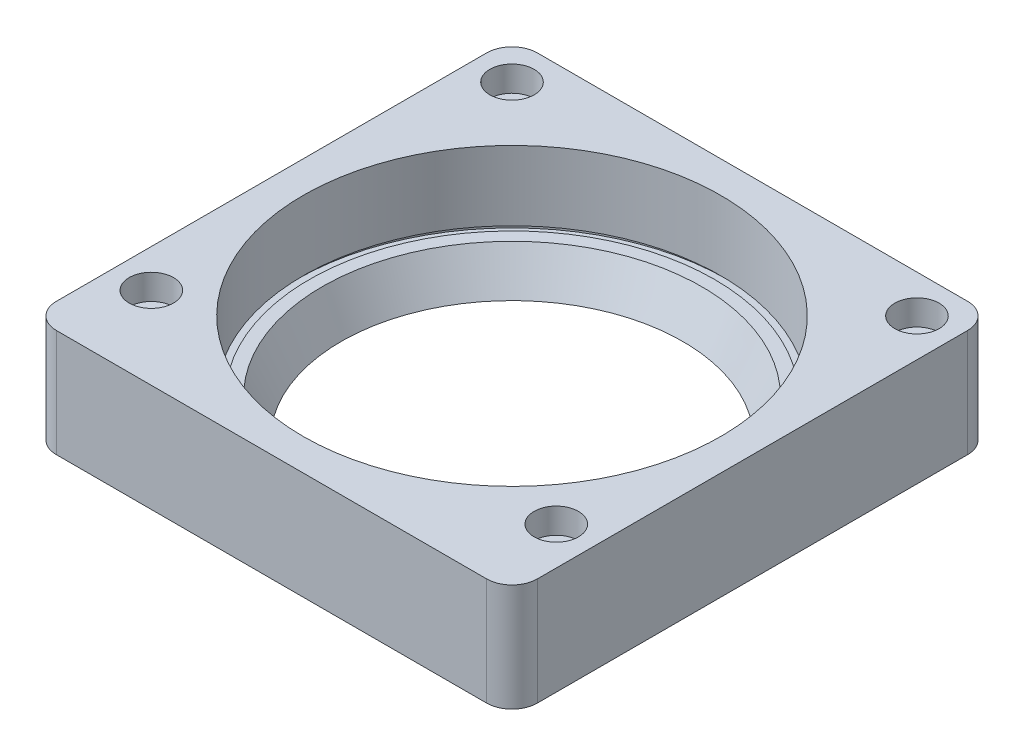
ISO-10303-21;
HEADER;
FILE_DESCRIPTION(('STEP AP214'),'2;1');
FILE_NAME('part.step','',(''),(''),'','','');
FILE_SCHEMA(('AUTOMOTIVE_DESIGN { 1 0 10303 214 1 1 1 1 }'));
ENDSEC;
DATA;
#1=APPLICATION_CONTEXT('core data for automotive mechanical design processes');
#2=APPLICATION_PROTOCOL_DEFINITION('international standard','automotive_design',2000,#1);
#3=PRODUCT_CONTEXT('',#1,'mechanical');
#4=PRODUCT('Part','Part','',(#3));
#5=PRODUCT_RELATED_PRODUCT_CATEGORY('part','',(#4));
#6=PRODUCT_DEFINITION_FORMATION('','',#4);
#7=PRODUCT_DEFINITION_CONTEXT('part definition',#1,'design');
#8=PRODUCT_DEFINITION('design','',#6,#7);
#9=PRODUCT_DEFINITION_SHAPE('','',#8);
#10=(LENGTH_UNIT() NAMED_UNIT(*) SI_UNIT(.MILLI.,.METRE.));
#11=(NAMED_UNIT(*) PLANE_ANGLE_UNIT() SI_UNIT($,.RADIAN.));
#12=(NAMED_UNIT(*) SI_UNIT($,.STERADIAN.) SOLID_ANGLE_UNIT());
#13=UNCERTAINTY_MEASURE_WITH_UNIT(LENGTH_MEASURE(1.E-05),#10,'distance_accuracy_value','');
#14=(GEOMETRIC_REPRESENTATION_CONTEXT(3) GLOBAL_UNCERTAINTY_ASSIGNED_CONTEXT((#13)) GLOBAL_UNIT_ASSIGNED_CONTEXT((#10,
#11,#12)) REPRESENTATION_CONTEXT('',''));
#15=CARTESIAN_POINT('',(0.,0.,0.));
#16=DIRECTION('',(0.,0.,1.));
#17=DIRECTION('',(1.,0.,0.));
#18=AXIS2_PLACEMENT_3D('',#15,#16,#17);
#19=CARTESIAN_POINT('',(-32.,17.,-32.));
#20=DIRECTION('',(0.,-1.,0.));
#21=DIRECTION('',(0.,0.,-1.));
#22=AXIS2_PLACEMENT_3D('',#19,#20,#21);
#23=CYLINDRICAL_SURFACE('',#22,1.5);
#24=CARTESIAN_POINT('',(-32.,0.,-32.));
#25=DIRECTION('',(0.,-1.,0.));
#26=DIRECTION('',(0.,0.,-1.));
#27=AXIS2_PLACEMENT_3D('',#24,#25,#26);
#28=CIRCLE('',#27,1.5);
#29=CARTESIAN_POINT('',(-32.,0.,-33.5));
#30=VERTEX_POINT('',#29);
#31=EDGE_CURVE('E842',#30,#30,#28,.T.);
#32=ORIENTED_EDGE('',*,*,#31,.T.);
#33=EDGE_LOOP('',(#32));
#34=FACE_BOUND('',#33,.T.);
#35=CARTESIAN_POINT('',(-32.,13.,-32.));
#36=DIRECTION('',(0.,1.,0.));
#37=DIRECTION('',(0.,0.,1.));
#38=AXIS2_PLACEMENT_3D('',#35,#36,#37);
#39=CIRCLE('',#38,1.5);
#40=CARTESIAN_POINT('',(-32.,13.,-30.5));
#41=VERTEX_POINT('',#40);
#42=EDGE_CURVE('E576',#41,#41,#39,.F.);
#43=ORIENTED_EDGE('',*,*,#42,.F.);
#44=EDGE_LOOP('',(#43));
#45=FACE_BOUND('',#44,.T.);
#46=ADVANCED_FACE('F26',(#34,#45),#23,.F.);
#47=CARTESIAN_POINT('',(-32.,17.,25.));
#48=DIRECTION('',(0.,-1.,0.));
#49=DIRECTION('',(0.,0.,-1.));
#50=AXIS2_PLACEMENT_3D('',#47,#48,#49);
#51=CYLINDRICAL_SURFACE('',#50,1.5);
#52=CARTESIAN_POINT('',(-32.,0.,25.));
#53=DIRECTION('',(0.,-1.,0.));
#54=DIRECTION('',(0.,0.,-1.));
#55=AXIS2_PLACEMENT_3D('',#52,#53,#54);
#56=CIRCLE('',#55,1.5);
#57=CARTESIAN_POINT('',(-32.,0.,23.5));
#58=VERTEX_POINT('',#57);
#59=EDGE_CURVE('E564',#58,#58,#56,.T.);
#60=ORIENTED_EDGE('',*,*,#59,.T.);
#61=EDGE_LOOP('',(#60));
#62=FACE_BOUND('',#61,.T.);
#63=CARTESIAN_POINT('',(-32.,13.,25.));
#64=DIRECTION('',(0.,1.,0.));
#65=DIRECTION('',(0.,0.,1.));
#66=AXIS2_PLACEMENT_3D('',#63,#64,#65);
#67=CIRCLE('',#66,1.5);
#68=CARTESIAN_POINT('',(-32.,13.,26.5));
#69=VERTEX_POINT('',#68);
#70=EDGE_CURVE('E571',#69,#69,#67,.F.);
#71=ORIENTED_EDGE('',*,*,#70,.F.);
#72=EDGE_LOOP('',(#71));
#73=FACE_BOUND('',#72,.T.);
#74=ADVANCED_FACE('F928',(#62,#73),#51,.F.);
#75=CARTESIAN_POINT('',(32.,17.,25.));
#76=DIRECTION('',(0.,-1.,0.));
#77=DIRECTION('',(0.,0.,-1.));
#78=AXIS2_PLACEMENT_3D('',#75,#76,#77);
#79=CYLINDRICAL_SURFACE('',#78,1.5);
#80=CARTESIAN_POINT('',(32.,0.,25.));
#81=DIRECTION('',(0.,-1.,0.));
#82=DIRECTION('',(0.,0.,-1.));
#83=AXIS2_PLACEMENT_3D('',#80,#81,#82);
#84=CIRCLE('',#83,1.5);
#85=CARTESIAN_POINT('',(32.,0.,23.5));
#86=VERTEX_POINT('',#85);
#87=EDGE_CURVE('E835',#86,#86,#84,.T.);
#88=ORIENTED_EDGE('',*,*,#87,.T.);
#89=EDGE_LOOP('',(#88));
#90=FACE_BOUND('',#89,.T.);
#91=CARTESIAN_POINT('',(32.,13.,25.));
#92=DIRECTION('',(0.,1.,0.));
#93=DIRECTION('',(0.,0.,1.));
#94=AXIS2_PLACEMENT_3D('',#91,#92,#93);
#95=CIRCLE('',#94,1.5);
#96=CARTESIAN_POINT('',(32.,13.,26.5));
#97=VERTEX_POINT('',#96);
#98=EDGE_CURVE('E566',#97,#97,#95,.F.);
#99=ORIENTED_EDGE('',*,*,#98,.F.);
#100=EDGE_LOOP('',(#99));
#101=FACE_BOUND('',#100,.T.);
#102=ADVANCED_FACE('F934',(#90,#101),#79,.F.);
#103=CARTESIAN_POINT('',(32.,17.,-32.));
#104=DIRECTION('',(0.,-1.,0.));
#105=DIRECTION('',(0.,0.,-1.));
#106=AXIS2_PLACEMENT_3D('',#103,#104,#105);
#107=CYLINDRICAL_SURFACE('',#106,1.5);
#108=CARTESIAN_POINT('',(32.,0.,-32.));
#109=DIRECTION('',(0.,-1.,0.));
#110=DIRECTION('',(0.,0.,-1.));
#111=AXIS2_PLACEMENT_3D('',#108,#109,#110);
#112=CIRCLE('',#111,1.5);
#113=CARTESIAN_POINT('',(32.,0.,-33.5));
#114=VERTEX_POINT('',#113);
#115=EDGE_CURVE('E837',#114,#114,#112,.T.);
#116=ORIENTED_EDGE('',*,*,#115,.T.);
#117=EDGE_LOOP('',(#116));
#118=FACE_BOUND('',#117,.T.);
#119=CARTESIAN_POINT('',(32.,13.,-32.));
#120=DIRECTION('',(0.,1.,0.));
#121=DIRECTION('',(0.,0.,1.));
#122=AXIS2_PLACEMENT_3D('',#119,#120,#121);
#123=CIRCLE('',#122,1.5);
#124=CARTESIAN_POINT('',(32.,13.,-30.5));
#125=VERTEX_POINT('',#124);
#126=EDGE_CURVE('E561',#125,#125,#123,.F.);
#127=ORIENTED_EDGE('',*,*,#126,.F.);
#128=EDGE_LOOP('',(#127));
#129=FACE_BOUND('',#128,.T.);
#130=ADVANCED_FACE('F940',(#118,#129),#107,.F.);
#131=CARTESIAN_POINT('',(34.5,14.,34.5));
#132=DIRECTION('',(-1.,0.,0.));
#133=DIRECTION('',(0.,0.,1.));
#134=AXIS2_PLACEMENT_3D('',#131,#132,#133);
#135=PLANE('',#134);
#136=DIRECTION('',(0.,0.,-1.));
#137=VECTOR('',#136,1.);
#138=CARTESIAN_POINT('',(34.5,0.,34.5));
#139=LINE('',#138,#137);
#140=CARTESIAN_POINT('',(34.5,0.,18.6754446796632));
#141=VERTEX_POINT('',#140);
#142=CARTESIAN_POINT('',(34.5,0.,15.708278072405));
#143=VERTEX_POINT('',#142);
#144=EDGE_CURVE('E456',#141,#143,#139,.T.);
#145=ORIENTED_EDGE('',*,*,#144,.F.);
#146=DIRECTION('',(0.,1.,0.));
#147=VECTOR('',#146,1.);
#148=CARTESIAN_POINT('',(34.5,17.,18.6754446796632));
#149=LINE('',#148,#147);
#150=CARTESIAN_POINT('',(34.5,14.,18.6754446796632));
#151=VERTEX_POINT('',#150);
#152=EDGE_CURVE('E662',#141,#151,#149,.T.);
#153=ORIENTED_EDGE('',*,*,#152,.T.);
#154=DIRECTION('',(0.,0.,-1.));
#155=VECTOR('',#154,1.);
#156=CARTESIAN_POINT('',(34.5,14.,34.5));
#157=LINE('',#156,#155);
#158=CARTESIAN_POINT('',(34.5,14.,5.89491306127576));
#159=VERTEX_POINT('',#158);
#160=EDGE_CURVE('E470',#151,#159,#157,.T.);
#161=ORIENTED_EDGE('',*,*,#160,.T.);
#162=DIRECTION('',(0.,-1.,0.));
#163=VECTOR('',#162,1.);
#164=CARTESIAN_POINT('',(34.5,14.,5.89491306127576));
#165=LINE('',#164,#163);
#166=CARTESIAN_POINT('',(34.5,6.,5.89491306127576));
#167=VERTEX_POINT('',#166);
#168=EDGE_CURVE('E434',#159,#167,#165,.T.);
#169=ORIENTED_EDGE('',*,*,#168,.T.);
#170=DIRECTION('',(0.,0.,-1.));
#171=VECTOR('',#170,1.);
#172=CARTESIAN_POINT('',(34.5,6.,0.));
#173=LINE('',#172,#171);
#174=CARTESIAN_POINT('',(34.5,6.,15.708278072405));
#175=VERTEX_POINT('',#174);
#176=EDGE_CURVE('E506',#175,#167,#173,.T.);
#177=ORIENTED_EDGE('',*,*,#176,.F.);
#178=DIRECTION('',(0.,1.,0.));
#179=VECTOR('',#178,1.);
#180=CARTESIAN_POINT('',(34.5,14.,15.708278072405));
#181=LINE('',#180,#179);
#182=EDGE_CURVE('E660',#175,#143,#181,.F.);
#183=ORIENTED_EDGE('',*,*,#182,.T.);
#184=EDGE_LOOP('',(#145,#153,#161,#169,#177,#183));
#185=FACE_BOUND('',#184,.T.);
#186=ADVANCED_FACE('F803',(#185),#135,.T.);
#187=CARTESIAN_POINT('',(0.,16.,0.));
#188=DIRECTION('',(0.,1.,0.));
#189=DIRECTION('',(0.,0.,1.));
#190=AXIS2_PLACEMENT_3D('',#187,#188,#189);
#191=CYLINDRICAL_SURFACE('',#190,36.);
#192=CARTESIAN_POINT('',(0.,6.,0.));
#193=DIRECTION('',(0.,1.,0.));
#194=DIRECTION('',(0.,0.,1.));
#195=AXIS2_PLACEMENT_3D('',#192,#193,#194);
#196=CIRCLE('',#195,36.);
#197=CARTESIAN_POINT('',(31.1768351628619,6.,18.0001374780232));
#198=VERTEX_POINT('',#197);
#199=CARTESIAN_POINT('',(32.5945945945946,6.,15.283730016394));
#200=VERTEX_POINT('',#199);
#201=EDGE_CURVE('E546',#198,#200,#196,.T.);
#202=ORIENTED_EDGE('',*,*,#201,.F.);
#203=DIRECTION('',(0.,1.,0.));
#204=VECTOR('',#203,1.);
#205=CARTESIAN_POINT('',(31.1768351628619,16.,18.0001374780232));
#206=LINE('',#205,#204);
#207=CARTESIAN_POINT('',(31.1768351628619,0.,18.0001374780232));
#208=VERTEX_POINT('',#207);
#209=EDGE_CURVE('E669',#198,#208,#206,.F.);
#210=ORIENTED_EDGE('',*,*,#209,.T.);
#211=CARTESIAN_POINT('',(0.,0.,0.));
#212=DIRECTION('',(0.,1.,0.));
#213=DIRECTION('',(0.,0.,1.));
#214=AXIS2_PLACEMENT_3D('',#211,#212,#213);
#215=CIRCLE('',#214,36.);
#216=CARTESIAN_POINT('',(32.5945945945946,0.,15.283730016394));
#217=VERTEX_POINT('',#216);
#218=EDGE_CURVE('E372',#208,#217,#215,.T.);
#219=ORIENTED_EDGE('',*,*,#218,.T.);
#220=DIRECTION('',(0.,1.,0.));
#221=VECTOR('',#220,1.);
#222=CARTESIAN_POINT('',(32.5945945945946,16.,15.283730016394));
#223=LINE('',#222,#221);
#224=EDGE_CURVE('E666',#217,#200,#223,.T.);
#225=ORIENTED_EDGE('',*,*,#224,.T.);
#226=EDGE_LOOP('',(#202,#210,#219,#225));
#227=FACE_BOUND('',#226,.T.);
#228=ADVANCED_FACE('F766',(#227),#191,.T.);
#229=CARTESIAN_POINT('',(36.,6.,0.));
#230=DIRECTION('',(0.,-1.,0.));
#231=DIRECTION('',(0.,0.,-1.));
#232=AXIS2_PLACEMENT_3D('',#229,#230,#231);
#233=PLANE('',#232);
#234=CARTESIAN_POINT('',(-32.,6.,25.));
#235=DIRECTION('',(0.,-1.,0.));
#236=DIRECTION('',(0.,0.,-1.));
#237=AXIS2_PLACEMENT_3D('',#234,#235,#236);
#238=CIRCLE('',#237,5.5);
#239=CARTESIAN_POINT('',(-26.5420522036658,6.,24.3211731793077));
#240=VERTEX_POINT('',#239);
#241=CARTESIAN_POINT('',(-32.0362647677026,6.,19.5001195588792));
#242=VERTEX_POINT('',#241);
#243=EDGE_CURVE('E382',#240,#242,#238,.F.);
#244=ORIENTED_EDGE('',*,*,#243,.F.);
#245=CARTESIAN_POINT('',(-15.283730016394,6.,32.5945945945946));
#246=VERTEX_POINT('',#245);
#247=EDGE_CURVE('E378',#240,#246,#196,.T.);
#248=ORIENTED_EDGE('',*,*,#247,.T.);
#249=CARTESIAN_POINT('',(-15.708278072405,6.,33.5));
#250=DIRECTION('',(0.,-1.,0.));
#251=DIRECTION('',(0.,0.,-1.));
#252=AXIS2_PLACEMENT_3D('',#249,#250,#251);
#253=CIRCLE('',#252,1.);
#254=CARTESIAN_POINT('',(-15.708278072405,6.,34.5));
#255=VERTEX_POINT('',#254);
#256=EDGE_CURVE('E732',#246,#255,#253,.T.);
#257=ORIENTED_EDGE('',*,*,#256,.T.);
#258=DIRECTION('',(1.,0.,0.));
#259=VECTOR('',#258,1.);
#260=CARTESIAN_POINT('',(36.,6.,34.5));
#261=LINE('',#260,#259);
#262=CARTESIAN_POINT('',(-5.89491306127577,6.,34.5));
#263=VERTEX_POINT('',#262);
#264=EDGE_CURVE('E369',#255,#263,#261,.T.);
#265=ORIENTED_EDGE('',*,*,#264,.T.);
#266=CARTESIAN_POINT('',(0.,6.,0.));
#267=DIRECTION('',(0.,1.,0.));
#268=DIRECTION('',(0.,0.,1.));
#269=AXIS2_PLACEMENT_3D('',#266,#267,#268);
#270=CIRCLE('',#269,35.);
#271=CARTESIAN_POINT('',(-34.5,6.,5.8949130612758));
#272=VERTEX_POINT('',#271);
#273=EDGE_CURVE('E413',#272,#263,#270,.T.);
#274=ORIENTED_EDGE('',*,*,#273,.F.);
#275=DIRECTION('',(0.,0.,1.));
#276=VECTOR('',#275,1.);
#277=CARTESIAN_POINT('',(-34.5,6.,0.));
#278=LINE('',#277,#276);
#279=CARTESIAN_POINT('',(-34.5,6.,15.708278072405));
#280=VERTEX_POINT('',#279);
#281=EDGE_CURVE('E488',#272,#280,#278,.T.);
#282=ORIENTED_EDGE('',*,*,#281,.T.);
#283=CARTESIAN_POINT('',(-33.5,6.,15.708278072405));
#284=DIRECTION('',(0.,-1.,0.));
#285=DIRECTION('',(0.,0.,-1.));
#286=AXIS2_PLACEMENT_3D('',#283,#284,#285);
#287=CIRCLE('',#286,1.);
#288=CARTESIAN_POINT('',(-32.5945945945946,6.,15.2837300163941));
#289=VERTEX_POINT('',#288);
#290=EDGE_CURVE('E708',#280,#289,#287,.T.);
#291=ORIENTED_EDGE('',*,*,#290,.T.);
#292=CARTESIAN_POINT('',(-31.1768351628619,6.,18.0001374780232));
#293=VERTEX_POINT('',#292);
#294=EDGE_CURVE('E547',#289,#293,#196,.T.);
#295=ORIENTED_EDGE('',*,*,#294,.T.);
#296=CARTESIAN_POINT('',(-32.0428583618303,6.,18.5001412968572));
#297=DIRECTION('',(0.,-1.,0.));
#298=DIRECTION('',(0.,0.,-1.));
#299=AXIS2_PLACEMENT_3D('',#296,#297,#298);
#300=CIRCLE('',#299,1.);
#301=EDGE_CURVE('E704',#293,#242,#300,.T.);
#302=ORIENTED_EDGE('',*,*,#301,.T.);
#303=EDGE_LOOP('',(#244,#248,#257,#265,#274,#282,#291,#295,#302));
#304=FACE_BOUND('',#303,.T.);
#305=ADVANCED_FACE('F984',(#304),#233,.F.);
#306=CARTESIAN_POINT('',(-34.5,14.,-34.5));
#307=DIRECTION('',(1.,0.,0.));
#308=DIRECTION('',(0.,0.,-1.));
#309=AXIS2_PLACEMENT_3D('',#306,#307,#308);
#310=PLANE('',#309);
#311=DIRECTION('',(0.,0.,1.));
#312=VECTOR('',#311,1.);
#313=CARTESIAN_POINT('',(-34.5,14.,-34.5));
#314=LINE('',#313,#312);
#315=CARTESIAN_POINT('',(-34.5,14.,29.8989794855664));
#316=VERTEX_POINT('',#315);
#317=CARTESIAN_POINT('',(-34.5,14.,33.5));
#318=VERTEX_POINT('',#317);
#319=EDGE_CURVE('E473',#316,#318,#314,.T.);
#320=ORIENTED_EDGE('',*,*,#319,.T.);
#321=DIRECTION('',(0.,-1.,0.));
#322=VECTOR('',#321,1.);
#323=CARTESIAN_POINT('',(-34.5,14.,33.5));
#324=LINE('',#323,#322);
#325=CARTESIAN_POINT('',(-34.5,0.,33.5));
#326=VERTEX_POINT('',#325);
#327=EDGE_CURVE('E719',#318,#326,#324,.T.);
#328=ORIENTED_EDGE('',*,*,#327,.T.);
#329=DIRECTION('',(0.,0.,1.));
#330=VECTOR('',#329,1.);
#331=CARTESIAN_POINT('',(-34.5,0.,-34.5));
#332=LINE('',#331,#330);
#333=CARTESIAN_POINT('',(-34.5,0.,29.8989794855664));
#334=VERTEX_POINT('',#333);
#335=EDGE_CURVE('E459',#334,#326,#332,.T.);
#336=ORIENTED_EDGE('',*,*,#335,.F.);
#337=DIRECTION('',(0.,-1.,0.));
#338=VECTOR('',#337,1.);
#339=CARTESIAN_POINT('',(-34.5,17.,29.8989794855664));
#340=LINE('',#339,#338);
#341=EDGE_CURVE('E387',#334,#316,#340,.F.);
#342=ORIENTED_EDGE('',*,*,#341,.T.);
#343=EDGE_LOOP('',(#320,#328,#336,#342));
#344=FACE_BOUND('',#343,.T.);
#345=ADVANCED_FACE('F980',(#344),#310,.T.);
#346=CARTESIAN_POINT('',(-34.5,14.,5.8949130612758));
#347=VERTEX_POINT('',#346);
#348=CARTESIAN_POINT('',(-34.5,14.,18.6754446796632));
#349=VERTEX_POINT('',#348);
#350=EDGE_CURVE('E477',#347,#349,#314,.T.);
#351=ORIENTED_EDGE('',*,*,#350,.T.);
#352=DIRECTION('',(0.,-1.,0.));
#353=VECTOR('',#352,1.);
#354=CARTESIAN_POINT('',(-34.5,14.,18.6754446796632));
#355=LINE('',#354,#353);
#356=CARTESIAN_POINT('',(-34.5,0.,18.6754446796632));
#357=VERTEX_POINT('',#356);
#358=EDGE_CURVE('E685',#349,#357,#355,.T.);
#359=ORIENTED_EDGE('',*,*,#358,.T.);
#360=CARTESIAN_POINT('',(-34.5,0.,15.708278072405));
#361=VERTEX_POINT('',#360);
#362=EDGE_CURVE('E463',#361,#357,#332,.T.);
#363=ORIENTED_EDGE('',*,*,#362,.F.);
#364=DIRECTION('',(0.,1.,0.));
#365=VECTOR('',#364,1.);
#366=CARTESIAN_POINT('',(-34.5,14.,15.708278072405));
#367=LINE('',#366,#365);
#368=EDGE_CURVE('E682',#361,#280,#367,.T.);
#369=ORIENTED_EDGE('',*,*,#368,.T.);
#370=ORIENTED_EDGE('',*,*,#281,.F.);
#371=DIRECTION('',(0.,-1.,0.));
#372=VECTOR('',#371,1.);
#373=CARTESIAN_POINT('',(-34.5,14.,5.8949130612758));
#374=LINE('',#373,#372);
#375=EDGE_CURVE('E425',#272,#347,#374,.F.);
#376=ORIENTED_EDGE('',*,*,#375,.T.);
#377=EDGE_LOOP('',(#351,#359,#363,#369,#370,#376));
#378=FACE_BOUND('',#377,.T.);
#379=ADVANCED_FACE('F983',(#378),#310,.T.);
#380=CARTESIAN_POINT('',(-26.5420522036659,0.,24.3211731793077));
#381=VERTEX_POINT('',#380);
#382=CARTESIAN_POINT('',(-15.283730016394,0.,32.5945945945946));
#383=VERTEX_POINT('',#382);
#384=EDGE_CURVE('E354',#381,#383,#215,.T.);
#385=ORIENTED_EDGE('',*,*,#384,.T.);
#386=DIRECTION('',(0.,1.,0.));
#387=VECTOR('',#386,1.);
#388=CARTESIAN_POINT('',(-15.283730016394,16.,32.5945945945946));
#389=LINE('',#388,#387);
#390=EDGE_CURVE('E728',#383,#246,#389,.T.);
#391=ORIENTED_EDGE('',*,*,#390,.T.);
#392=ORIENTED_EDGE('',*,*,#247,.F.);
#393=DIRECTION('',(0.,-1.,0.));
#394=VECTOR('',#393,1.);
#395=CARTESIAN_POINT('',(-26.5420522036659,8.5,24.3211731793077));
#396=LINE('',#395,#394);
#397=EDGE_CURVE('E375',#381,#240,#396,.F.);
#398=ORIENTED_EDGE('',*,*,#397,.F.);
#399=EDGE_LOOP('',(#385,#391,#392,#398));
#400=FACE_BOUND('',#399,.T.);
#401=ADVANCED_FACE('F376',(#400),#191,.T.);
#402=CARTESIAN_POINT('',(-32.5945945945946,0.,15.2837300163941));
#403=VERTEX_POINT('',#402);
#404=CARTESIAN_POINT('',(-31.1768351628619,0.,18.0001374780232));
#405=VERTEX_POINT('',#404);
#406=EDGE_CURVE('E368',#403,#405,#215,.T.);
#407=ORIENTED_EDGE('',*,*,#406,.T.);
#408=DIRECTION('',(0.,1.,0.));
#409=VECTOR('',#408,1.);
#410=CARTESIAN_POINT('',(-31.1768351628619,16.,18.0001374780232));
#411=LINE('',#410,#409);
#412=EDGE_CURVE('E698',#405,#293,#411,.T.);
#413=ORIENTED_EDGE('',*,*,#412,.T.);
#414=ORIENTED_EDGE('',*,*,#294,.F.);
#415=DIRECTION('',(0.,1.,0.));
#416=VECTOR('',#415,1.);
#417=CARTESIAN_POINT('',(-32.5945945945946,16.,15.2837300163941));
#418=LINE('',#417,#416);
#419=EDGE_CURVE('E695',#289,#403,#418,.F.);
#420=ORIENTED_EDGE('',*,*,#419,.T.);
#421=EDGE_LOOP('',(#407,#413,#414,#420));
#422=FACE_BOUND('',#421,.T.);
#423=ADVANCED_FACE('F961',(#422),#191,.T.);
#424=CARTESIAN_POINT('',(38.,14.,-38.));
#425=DIRECTION('',(0.,-1.,0.));
#426=DIRECTION('',(0.,0.,-1.));
#427=AXIS2_PLACEMENT_3D('',#424,#425,#426);
#428=PLANE('',#427);
#429=DIRECTION('',(1.,0.,0.));
#430=VECTOR('',#429,1.);
#431=CARTESIAN_POINT('',(-34.5,14.,34.5));
#432=LINE('',#431,#430);
#433=CARTESIAN_POINT('',(-33.5,14.,34.5));
#434=VERTEX_POINT('',#433);
#435=CARTESIAN_POINT('',(-5.89491306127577,14.,34.5));
#436=VERTEX_POINT('',#435);
#437=EDGE_CURVE('E464',#434,#436,#432,.T.);
#438=ORIENTED_EDGE('',*,*,#437,.F.);
#439=CARTESIAN_POINT('',(-33.5,14.,33.5));
#440=DIRECTION('',(0.,-1.,0.));
#441=DIRECTION('',(0.,0.,-1.));
#442=AXIS2_PLACEMENT_3D('',#439,#440,#441);
#443=CIRCLE('',#442,1.);
#444=EDGE_CURVE('E724',#434,#318,#443,.T.);
#445=ORIENTED_EDGE('',*,*,#444,.T.);
#446=ORIENTED_EDGE('',*,*,#319,.F.);
#447=CARTESIAN_POINT('',(-32.,14.,25.));
#448=DIRECTION('',(0.,-1.,0.));
#449=DIRECTION('',(0.,0.,-1.));
#450=AXIS2_PLACEMENT_3D('',#447,#448,#449);
#451=CIRCLE('',#450,5.5);
#452=CARTESIAN_POINT('',(-33.2692307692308,14.,19.6484531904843));
#453=VERTEX_POINT('',#452);
#454=EDGE_CURVE('E545',#316,#453,#451,.F.);
#455=ORIENTED_EDGE('',*,*,#454,.T.);
#456=CARTESIAN_POINT('',(-33.5,14.,18.6754446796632));
#457=DIRECTION('',(0.,-1.,0.));
#458=DIRECTION('',(0.,0.,-1.));
#459=AXIS2_PLACEMENT_3D('',#456,#457,#458);
#460=CIRCLE('',#459,1.);
#461=EDGE_CURVE('E693',#453,#349,#460,.T.);
#462=ORIENTED_EDGE('',*,*,#461,.T.);
#463=ORIENTED_EDGE('',*,*,#350,.F.);
#464=CARTESIAN_POINT('',(0.,14.,0.));
#465=DIRECTION('',(0.,1.,0.));
#466=DIRECTION('',(0.,0.,1.));
#467=AXIS2_PLACEMENT_3D('',#464,#465,#466);
#468=CIRCLE('',#467,35.);
#469=EDGE_CURVE('E416',#347,#436,#468,.T.);
#470=ORIENTED_EDGE('',*,*,#469,.T.);
#471=EDGE_LOOP('',(#438,#445,#446,#455,#462,#463,#470));
#472=FACE_BOUND('',#471,.T.);
#473=ADVANCED_FACE('F958',(#472),#428,.T.);
#474=CARTESIAN_POINT('',(-5.89491306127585,6.,-34.5));
#475=VERTEX_POINT('',#474);
#476=CARTESIAN_POINT('',(-34.5,6.,-5.8949130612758));
#477=VERTEX_POINT('',#476);
#478=EDGE_CURVE('E1058',#475,#477,#270,.T.);
#479=ORIENTED_EDGE('',*,*,#478,.F.);
#480=DIRECTION('',(-1.,0.,0.));
#481=VECTOR('',#480,1.);
#482=CARTESIAN_POINT('',(36.,6.,-34.5));
#483=LINE('',#482,#481);
#484=CARTESIAN_POINT('',(-10.2834819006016,6.,-34.5));
#485=VERTEX_POINT('',#484);
#486=EDGE_CURVE('E495',#475,#485,#483,.T.);
#487=ORIENTED_EDGE('',*,*,#486,.T.);
#488=CARTESIAN_POINT('',(-34.5,6.,-10.2834819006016));
#489=VERTEX_POINT('',#488);
#490=EDGE_CURVE('E1063',#485,#489,#196,.T.);
#491=ORIENTED_EDGE('',*,*,#490,.T.);
#492=EDGE_CURVE('E489',#489,#477,#278,.T.);
#493=ORIENTED_EDGE('',*,*,#492,.T.);
#494=EDGE_LOOP('',(#479,#487,#491,#493));
#495=FACE_BOUND('',#494,.T.);
#496=ADVANCED_FACE('F960',(#495),#233,.F.);
#497=CARTESIAN_POINT('',(5.89491306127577,6.,34.5));
#498=VERTEX_POINT('',#497);
#499=CARTESIAN_POINT('',(15.708278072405,6.,34.5));
#500=VERTEX_POINT('',#499);
#501=EDGE_CURVE('E40',#498,#500,#261,.T.);
#502=ORIENTED_EDGE('',*,*,#501,.T.);
#503=CARTESIAN_POINT('',(15.708278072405,6.,33.5));
#504=DIRECTION('',(0.,-1.,0.));
#505=DIRECTION('',(0.,0.,-1.));
#506=AXIS2_PLACEMENT_3D('',#503,#504,#505);
#507=CIRCLE('',#506,1.);
#508=CARTESIAN_POINT('',(15.283730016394,6.,32.5945945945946));
#509=VERTEX_POINT('',#508);
#510=EDGE_CURVE('E11',#500,#509,#507,.T.);
#511=ORIENTED_EDGE('',*,*,#510,.T.);
#512=CARTESIAN_POINT('',(26.5420522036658,6.,24.3211731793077));
#513=VERTEX_POINT('',#512);
#514=EDGE_CURVE('E543',#509,#513,#196,.T.);
#515=ORIENTED_EDGE('',*,*,#514,.T.);
#516=CARTESIAN_POINT('',(32.,6.,25.));
#517=DIRECTION('',(0.,-1.,0.));
#518=DIRECTION('',(0.,0.,-1.));
#519=AXIS2_PLACEMENT_3D('',#516,#517,#518);
#520=CIRCLE('',#519,5.5);
#521=CARTESIAN_POINT('',(32.0362647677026,6.,19.5001195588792));
#522=VERTEX_POINT('',#521);
#523=EDGE_CURVE('E389',#513,#522,#520,.T.);
#524=ORIENTED_EDGE('',*,*,#523,.T.);
#525=CARTESIAN_POINT('',(32.0428583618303,6.,18.5001412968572));
#526=DIRECTION('',(0.,-1.,0.));
#527=DIRECTION('',(0.,0.,-1.));
#528=AXIS2_PLACEMENT_3D('',#525,#526,#527);
#529=CIRCLE('',#528,1.);
#530=EDGE_CURVE('E676',#522,#198,#529,.T.);
#531=ORIENTED_EDGE('',*,*,#530,.T.);
#532=ORIENTED_EDGE('',*,*,#201,.T.);
#533=CARTESIAN_POINT('',(33.5,6.,15.708278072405));
#534=DIRECTION('',(0.,-1.,0.));
#535=DIRECTION('',(0.,0.,-1.));
#536=AXIS2_PLACEMENT_3D('',#533,#534,#535);
#537=CIRCLE('',#536,1.);
#538=EDGE_CURVE('E678',#200,#175,#537,.T.);
#539=ORIENTED_EDGE('',*,*,#538,.T.);
#540=ORIENTED_EDGE('',*,*,#176,.T.);
#541=EDGE_CURVE('E414',#498,#167,#270,.T.);
#542=ORIENTED_EDGE('',*,*,#541,.F.);
#543=EDGE_LOOP('',(#502,#511,#515,#524,#531,#532,#539,#540,#542));
#544=FACE_BOUND('',#543,.T.);
#545=ADVANCED_FACE('F747',(#544),#233,.F.);
#546=CARTESIAN_POINT('',(34.5,6.,-5.89491306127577));
#547=VERTEX_POINT('',#546);
#548=CARTESIAN_POINT('',(5.89491306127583,6.,-34.5));
#549=VERTEX_POINT('',#548);
#550=EDGE_CURVE('E417',#547,#549,#270,.T.);
#551=ORIENTED_EDGE('',*,*,#550,.F.);
#552=CARTESIAN_POINT('',(34.5,6.,-10.2834819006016));
#553=VERTEX_POINT('',#552);
#554=EDGE_CURVE('E505',#547,#553,#173,.T.);
#555=ORIENTED_EDGE('',*,*,#554,.T.);
#556=CARTESIAN_POINT('',(10.2834819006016,6.,-34.5));
#557=VERTEX_POINT('',#556);
#558=EDGE_CURVE('E548',#553,#557,#196,.T.);
#559=ORIENTED_EDGE('',*,*,#558,.T.);
#560=EDGE_CURVE('E496',#557,#549,#483,.T.);
#561=ORIENTED_EDGE('',*,*,#560,.T.);
#562=EDGE_LOOP('',(#551,#555,#559,#561));
#563=FACE_BOUND('',#562,.T.);
#564=ADVANCED_FACE('F979',(#563),#233,.F.);
#565=CARTESIAN_POINT('',(-34.5,14.,34.5));
#566=DIRECTION('',(0.,0.,-1.));
#567=DIRECTION('',(-1.,0.,0.));
#568=AXIS2_PLACEMENT_3D('',#565,#566,#567);
#569=PLANE('',#568);
#570=DIRECTION('',(1.,0.,0.));
#571=VECTOR('',#570,1.);
#572=CARTESIAN_POINT('',(-34.5,0.,34.5));
#573=LINE('',#572,#571);
#574=CARTESIAN_POINT('',(15.708278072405,0.,34.5));
#575=VERTEX_POINT('',#574);
#576=CARTESIAN_POINT('',(33.5,0.,34.5));
#577=VERTEX_POINT('',#576);
#578=EDGE_CURVE('E449',#575,#577,#573,.T.);
#579=ORIENTED_EDGE('',*,*,#578,.F.);
#580=DIRECTION('',(0.,1.,0.));
#581=VECTOR('',#580,1.);
#582=CARTESIAN_POINT('',(15.708278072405,14.,34.5));
#583=LINE('',#582,#581);
#584=EDGE_CURVE('E738',#575,#500,#583,.T.);
#585=ORIENTED_EDGE('',*,*,#584,.T.);
#586=ORIENTED_EDGE('',*,*,#501,.F.);
#587=DIRECTION('',(0.,-1.,0.));
#588=VECTOR('',#587,1.);
#589=CARTESIAN_POINT('',(5.89491306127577,14.,34.5));
#590=LINE('',#589,#588);
#591=CARTESIAN_POINT('',(5.89491306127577,14.,34.5));
#592=VERTEX_POINT('',#591);
#593=EDGE_CURVE('E443',#498,#592,#590,.F.);
#594=ORIENTED_EDGE('',*,*,#593,.T.);
#595=CARTESIAN_POINT('',(33.5,14.,34.5));
#596=VERTEX_POINT('',#595);
#597=EDGE_CURVE('E462',#592,#596,#432,.T.);
#598=ORIENTED_EDGE('',*,*,#597,.T.);
#599=DIRECTION('',(0.,-1.,0.));
#600=VECTOR('',#599,1.);
#601=CARTESIAN_POINT('',(33.5,14.,34.5));
#602=LINE('',#601,#600);
#603=EDGE_CURVE('E710',#596,#577,#602,.T.);
#604=ORIENTED_EDGE('',*,*,#603,.T.);
#605=EDGE_LOOP('',(#579,#585,#586,#594,#598,#604));
#606=FACE_BOUND('',#605,.T.);
#607=ADVANCED_FACE('F742',(#606),#569,.T.);
#608=ORIENTED_EDGE('',*,*,#264,.F.);
#609=DIRECTION('',(0.,1.,0.));
#610=VECTOR('',#609,1.);
#611=CARTESIAN_POINT('',(-15.708278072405,14.,34.5));
#612=LINE('',#611,#610);
#613=CARTESIAN_POINT('',(-15.708278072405,0.,34.5));
#614=VERTEX_POINT('',#613);
#615=EDGE_CURVE('E730',#255,#614,#612,.F.);
#616=ORIENTED_EDGE('',*,*,#615,.T.);
#617=CARTESIAN_POINT('',(-33.5,0.,34.5));
#618=VERTEX_POINT('',#617);
#619=EDGE_CURVE('E450',#618,#614,#573,.T.);
#620=ORIENTED_EDGE('',*,*,#619,.F.);
#621=DIRECTION('',(0.,-1.,0.));
#622=VECTOR('',#621,1.);
#623=CARTESIAN_POINT('',(-33.5,14.,34.5));
#624=LINE('',#623,#622);
#625=EDGE_CURVE('E722',#618,#434,#624,.F.);
#626=ORIENTED_EDGE('',*,*,#625,.T.);
#627=ORIENTED_EDGE('',*,*,#437,.T.);
#628=DIRECTION('',(0.,-1.,0.));
#629=VECTOR('',#628,1.);
#630=CARTESIAN_POINT('',(-5.89491306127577,14.,34.5));
#631=LINE('',#630,#629);
#632=EDGE_CURVE('E440',#436,#263,#631,.T.);
#633=ORIENTED_EDGE('',*,*,#632,.T.);
#634=EDGE_LOOP('',(#608,#616,#620,#626,#627,#633));
#635=FACE_BOUND('',#634,.T.);
#636=ADVANCED_FACE('F978',(#635),#569,.T.);
#637=CARTESIAN_POINT('',(34.5,14.,-5.89491306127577));
#638=VERTEX_POINT('',#637);
#639=CARTESIAN_POINT('',(34.5,14.,-26.1905249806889));
#640=VERTEX_POINT('',#639);
#641=EDGE_CURVE('E466',#638,#640,#157,.T.);
#642=ORIENTED_EDGE('',*,*,#641,.T.);
#643=DIRECTION('',(0.,1.,0.));
#644=VECTOR('',#643,1.);
#645=CARTESIAN_POINT('',(34.5,17.,-26.1905249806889));
#646=LINE('',#645,#644);
#647=CARTESIAN_POINT('',(34.5,0.,-26.1905249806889));
#648=VERTEX_POINT('',#647);
#649=EDGE_CURVE('E630',#640,#648,#646,.F.);
#650=ORIENTED_EDGE('',*,*,#649,.T.);
#651=CARTESIAN_POINT('',(34.5,0.,-10.2834819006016));
#652=VERTEX_POINT('',#651);
#653=EDGE_CURVE('E452',#652,#648,#139,.T.);
#654=ORIENTED_EDGE('',*,*,#653,.F.);
#655=DIRECTION('',(0.,1.,0.));
#656=VECTOR('',#655,1.);
#657=CARTESIAN_POINT('',(34.5,16.,-10.2834819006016));
#658=LINE('',#657,#656);
#659=EDGE_CURVE('E509',#553,#652,#658,.F.);
#660=ORIENTED_EDGE('',*,*,#659,.F.);
#661=ORIENTED_EDGE('',*,*,#554,.F.);
#662=DIRECTION('',(0.,-1.,0.));
#663=VECTOR('',#662,1.);
#664=CARTESIAN_POINT('',(34.5,14.,-5.89491306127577));
#665=LINE('',#664,#663);
#666=EDGE_CURVE('E437',#547,#638,#665,.F.);
#667=ORIENTED_EDGE('',*,*,#666,.T.);
#668=EDGE_LOOP('',(#642,#650,#654,#660,#661,#667));
#669=FACE_BOUND('',#668,.T.);
#670=ADVANCED_FACE('F992',(#669),#135,.T.);
#671=CARTESIAN_POINT('',(34.5,0.,33.5));
#672=VERTEX_POINT('',#671);
#673=CARTESIAN_POINT('',(34.5,0.,29.8989794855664));
#674=VERTEX_POINT('',#673);
#675=EDGE_CURVE('E453',#672,#674,#139,.T.);
#676=ORIENTED_EDGE('',*,*,#675,.F.);
#677=DIRECTION('',(0.,-1.,0.));
#678=VECTOR('',#677,1.);
#679=CARTESIAN_POINT('',(34.5,14.,33.5));
#680=LINE('',#679,#678);
#681=CARTESIAN_POINT('',(34.5,14.,33.5));
#682=VERTEX_POINT('',#681);
#683=EDGE_CURVE('E713',#672,#682,#680,.F.);
#684=ORIENTED_EDGE('',*,*,#683,.T.);
#685=CARTESIAN_POINT('',(34.5,14.,29.8989794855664));
#686=VERTEX_POINT('',#685);
#687=EDGE_CURVE('E467',#682,#686,#157,.T.);
#688=ORIENTED_EDGE('',*,*,#687,.T.);
#689=DIRECTION('',(0.,-1.,0.));
#690=VECTOR('',#689,1.);
#691=CARTESIAN_POINT('',(34.5,17.,29.8989794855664));
#692=LINE('',#691,#690);
#693=EDGE_CURVE('E756',#674,#686,#692,.F.);
#694=ORIENTED_EDGE('',*,*,#693,.F.);
#695=EDGE_LOOP('',(#676,#684,#688,#694));
#696=FACE_BOUND('',#695,.T.);
#697=ADVANCED_FACE('F788',(#696),#135,.T.);
#698=CARTESIAN_POINT('',(34.5,14.,-34.5));
#699=DIRECTION('',(0.,0.,1.));
#700=DIRECTION('',(1.,0.,0.));
#701=AXIS2_PLACEMENT_3D('',#698,#699,#700);
#702=PLANE('',#701);
#703=DIRECTION('',(-1.,0.,0.));
#704=VECTOR('',#703,1.);
#705=CARTESIAN_POINT('',(34.5,14.,-34.5));
#706=LINE('',#705,#704);
#707=CARTESIAN_POINT('',(-5.89491306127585,14.,-34.5));
#708=VERTEX_POINT('',#707);
#709=CARTESIAN_POINT('',(-26.1905249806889,14.,-34.5));
#710=VERTEX_POINT('',#709);
#711=EDGE_CURVE('E469',#708,#710,#706,.T.);
#712=ORIENTED_EDGE('',*,*,#711,.T.);
#713=DIRECTION('',(0.,1.,0.));
#714=VECTOR('',#713,1.);
#715=CARTESIAN_POINT('',(-26.1905249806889,17.,-34.5));
#716=LINE('',#715,#714);
#717=CARTESIAN_POINT('',(-26.1905249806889,0.,-34.5));
#718=VERTEX_POINT('',#717);
#719=EDGE_CURVE('E646',#710,#718,#716,.F.);
#720=ORIENTED_EDGE('',*,*,#719,.T.);
#721=DIRECTION('',(-1.,0.,0.));
#722=VECTOR('',#721,1.);
#723=CARTESIAN_POINT('',(34.5,0.,-34.5));
#724=LINE('',#723,#722);
#725=CARTESIAN_POINT('',(-10.2834819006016,0.,-34.5));
#726=VERTEX_POINT('',#725);
#727=EDGE_CURVE('E455',#726,#718,#724,.T.);
#728=ORIENTED_EDGE('',*,*,#727,.F.);
#729=DIRECTION('',(0.,1.,0.));
#730=VECTOR('',#729,1.);
#731=CARTESIAN_POINT('',(-10.2834819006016,16.,-34.5));
#732=LINE('',#731,#730);
#733=EDGE_CURVE('E499',#485,#726,#732,.F.);
#734=ORIENTED_EDGE('',*,*,#733,.F.);
#735=ORIENTED_EDGE('',*,*,#486,.F.);
#736=DIRECTION('',(0.,-1.,0.));
#737=VECTOR('',#736,1.);
#738=CARTESIAN_POINT('',(-5.89491306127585,14.,-34.5));
#739=LINE('',#738,#737);
#740=EDGE_CURVE('E431',#475,#708,#739,.F.);
#741=ORIENTED_EDGE('',*,*,#740,.T.);
#742=EDGE_LOOP('',(#712,#720,#728,#734,#735,#741));
#743=FACE_BOUND('',#742,.T.);
#744=ADVANCED_FACE('F987',(#743),#702,.T.);
#745=CARTESIAN_POINT('',(26.1905249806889,0.,-34.5));
#746=VERTEX_POINT('',#745);
#747=CARTESIAN_POINT('',(10.2834819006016,0.,-34.5));
#748=VERTEX_POINT('',#747);
#749=EDGE_CURVE('E457',#746,#748,#724,.T.);
#750=ORIENTED_EDGE('',*,*,#749,.F.);
#751=DIRECTION('',(0.,1.,0.));
#752=VECTOR('',#751,1.);
#753=CARTESIAN_POINT('',(26.1905249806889,17.,-34.5));
#754=LINE('',#753,#752);
#755=CARTESIAN_POINT('',(26.1905249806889,14.,-34.5));
#756=VERTEX_POINT('',#755);
#757=EDGE_CURVE('E624',#746,#756,#754,.T.);
#758=ORIENTED_EDGE('',*,*,#757,.T.);
#759=CARTESIAN_POINT('',(5.89491306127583,14.,-34.5));
#760=VERTEX_POINT('',#759);
#761=EDGE_CURVE('E471',#756,#760,#706,.T.);
#762=ORIENTED_EDGE('',*,*,#761,.T.);
#763=DIRECTION('',(0.,-1.,0.));
#764=VECTOR('',#763,1.);
#765=CARTESIAN_POINT('',(5.89491306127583,14.,-34.5));
#766=LINE('',#765,#764);
#767=EDGE_CURVE('E428',#760,#549,#766,.T.);
#768=ORIENTED_EDGE('',*,*,#767,.T.);
#769=ORIENTED_EDGE('',*,*,#560,.F.);
#770=DIRECTION('',(0.,1.,0.));
#771=VECTOR('',#770,1.);
#772=CARTESIAN_POINT('',(10.2834819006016,16.,-34.5));
#773=LINE('',#772,#771);
#774=EDGE_CURVE('E502',#748,#557,#773,.T.);
#775=ORIENTED_EDGE('',*,*,#774,.F.);
#776=EDGE_LOOP('',(#750,#758,#762,#768,#769,#775));
#777=FACE_BOUND('',#776,.T.);
#778=ADVANCED_FACE('F990',(#777),#702,.T.);
#779=CARTESIAN_POINT('',(-34.5,0.,-26.1905249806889));
#780=VERTEX_POINT('',#779);
#781=CARTESIAN_POINT('',(-34.5,0.,-10.2834819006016));
#782=VERTEX_POINT('',#781);
#783=EDGE_CURVE('E460',#780,#782,#332,.T.);
#784=ORIENTED_EDGE('',*,*,#783,.F.);
#785=DIRECTION('',(0.,1.,0.));
#786=VECTOR('',#785,1.);
#787=CARTESIAN_POINT('',(-34.5,17.,-26.1905249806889));
#788=LINE('',#787,#786);
#789=CARTESIAN_POINT('',(-34.5,14.,-26.1905249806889));
#790=VERTEX_POINT('',#789);
#791=EDGE_CURVE('E648',#780,#790,#788,.T.);
#792=ORIENTED_EDGE('',*,*,#791,.T.);
#793=CARTESIAN_POINT('',(-34.5,14.,-5.8949130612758));
#794=VERTEX_POINT('',#793);
#795=EDGE_CURVE('E474',#790,#794,#314,.T.);
#796=ORIENTED_EDGE('',*,*,#795,.T.);
#797=DIRECTION('',(0.,-1.,0.));
#798=VECTOR('',#797,1.);
#799=CARTESIAN_POINT('',(-34.5,14.,-5.8949130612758));
#800=LINE('',#799,#798);
#801=EDGE_CURVE('E421',#794,#477,#800,.T.);
#802=ORIENTED_EDGE('',*,*,#801,.T.);
#803=ORIENTED_EDGE('',*,*,#492,.F.);
#804=DIRECTION('',(0.,1.,0.));
#805=VECTOR('',#804,1.);
#806=CARTESIAN_POINT('',(-34.5,16.,-10.2834819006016));
#807=LINE('',#806,#805);
#808=EDGE_CURVE('E492',#782,#489,#807,.T.);
#809=ORIENTED_EDGE('',*,*,#808,.F.);
#810=EDGE_LOOP('',(#784,#792,#796,#802,#803,#809));
#811=FACE_BOUND('',#810,.T.);
#812=ADVANCED_FACE('F986',(#811),#310,.T.);
#813=ORIENTED_EDGE('',*,*,#514,.F.);
#814=DIRECTION('',(0.,1.,0.));
#815=VECTOR('',#814,1.);
#816=CARTESIAN_POINT('',(15.283730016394,16.,32.5945945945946));
#817=LINE('',#816,#815);
#818=CARTESIAN_POINT('',(15.283730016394,0.,32.5945945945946));
#819=VERTEX_POINT('',#818);
#820=EDGE_CURVE('E735',#509,#819,#817,.F.);
#821=ORIENTED_EDGE('',*,*,#820,.T.);
#822=CARTESIAN_POINT('',(26.5420522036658,0.,24.3211731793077));
#823=VERTEX_POINT('',#822);
#824=EDGE_CURVE('E513',#819,#823,#215,.T.);
#825=ORIENTED_EDGE('',*,*,#824,.T.);
#826=DIRECTION('',(0.,-1.,0.));
#827=VECTOR('',#826,1.);
#828=CARTESIAN_POINT('',(26.5420522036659,8.5,24.3211731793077));
#829=LINE('',#828,#827);
#830=EDGE_CURVE('E391',#823,#513,#829,.F.);
#831=ORIENTED_EDGE('',*,*,#830,.T.);
#832=EDGE_LOOP('',(#813,#821,#825,#831));
#833=FACE_BOUND('',#832,.T.);
#834=ADVANCED_FACE('F750',(#833),#191,.T.);
#835=ORIENTED_EDGE('',*,*,#558,.F.);
#836=ORIENTED_EDGE('',*,*,#659,.T.);
#837=EDGE_CURVE('E516',#652,#748,#215,.T.);
#838=ORIENTED_EDGE('',*,*,#837,.T.);
#839=ORIENTED_EDGE('',*,*,#774,.T.);
#840=EDGE_LOOP('',(#835,#836,#838,#839));
#841=FACE_BOUND('',#840,.T.);
#842=ADVANCED_FACE('F1061',(#841),#191,.T.);
#843=ORIENTED_EDGE('',*,*,#490,.F.);
#844=ORIENTED_EDGE('',*,*,#733,.T.);
#845=EDGE_CURVE('E371',#726,#782,#215,.T.);
#846=ORIENTED_EDGE('',*,*,#845,.T.);
#847=ORIENTED_EDGE('',*,*,#808,.T.);
#848=EDGE_LOOP('',(#843,#844,#846,#847));
#849=FACE_BOUND('',#848,.T.);
#850=ADVANCED_FACE('F28',(#849),#191,.T.);
#851=CARTESIAN_POINT('',(0.,16.,0.));
#852=DIRECTION('',(0.,1.,0.));
#853=DIRECTION('',(0.,0.,1.));
#854=AXIS2_PLACEMENT_3D('',#851,#852,#853);
#855=CYLINDRICAL_SURFACE('',#854,34.);
#856=CARTESIAN_POINT('',(0.,5.,0.));
#857=DIRECTION('',(0.,1.,0.));
#858=DIRECTION('',(0.,0.,1.));
#859=AXIS2_PLACEMENT_3D('',#856,#857,#858);
#860=CIRCLE('',#859,34.);
#861=CARTESIAN_POINT('',(0.,5.,34.));
#862=VERTEX_POINT('',#861);
#863=EDGE_CURVE('E540',#862,#862,#860,.T.);
#864=ORIENTED_EDGE('',*,*,#863,.F.);
#865=EDGE_LOOP('',(#864));
#866=FACE_BOUND('',#865,.T.);
#867=CARTESIAN_POINT('',(0.,6.,0.));
#868=DIRECTION('',(0.,1.,0.));
#869=DIRECTION('',(0.,0.,1.));
#870=AXIS2_PLACEMENT_3D('',#867,#868,#869);
#871=CIRCLE('',#870,34.);
#872=CARTESIAN_POINT('',(0.,6.,34.));
#873=VERTEX_POINT('',#872);
#874=EDGE_CURVE('E446',#873,#873,#871,.F.);
#875=ORIENTED_EDGE('',*,*,#874,.F.);
#876=EDGE_LOOP('',(#875));
#877=FACE_BOUND('',#876,.T.);
#878=ADVANCED_FACE('F1037',(#866,#877),#855,.F.);
#879=CARTESIAN_POINT('',(34.,5.,0.));
#880=DIRECTION('',(0.,-1.,0.));
#881=DIRECTION('',(0.,0.,-1.));
#882=AXIS2_PLACEMENT_3D('',#879,#880,#881);
#883=PLANE('',#882);
#884=CARTESIAN_POINT('',(0.,5.,0.));
#885=DIRECTION('',(0.,1.,0.));
#886=DIRECTION('',(0.,0.,1.));
#887=AXIS2_PLACEMENT_3D('',#884,#885,#886);
#888=CIRCLE('',#887,32.);
#889=CARTESIAN_POINT('',(0.,5.,32.));
#890=VERTEX_POINT('',#889);
#891=EDGE_CURVE('E537',#890,#890,#888,.T.);
#892=ORIENTED_EDGE('',*,*,#891,.F.);
#893=EDGE_LOOP('',(#892));
#894=FACE_BOUND('',#893,.T.);
#895=ORIENTED_EDGE('',*,*,#863,.T.);
#896=EDGE_LOOP('',(#895));
#897=FACE_BOUND('',#896,.T.);
#898=ADVANCED_FACE('F1033',(#894,#897),#883,.F.);
#899=CARTESIAN_POINT('',(0.,16.,0.));
#900=DIRECTION('',(0.,1.,0.));
#901=DIRECTION('',(0.,0.,1.));
#902=AXIS2_PLACEMENT_3D('',#899,#900,#901);
#903=CYLINDRICAL_SURFACE('',#902,32.);
#904=CARTESIAN_POINT('',(0.,6.00000000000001,0.));
#905=DIRECTION('',(0.,1.,0.));
#906=DIRECTION('',(0.,0.,1.));
#907=AXIS2_PLACEMENT_3D('',#904,#905,#906);
#908=CIRCLE('',#907,32.);
#909=CARTESIAN_POINT('',(0.,6.00000000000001,32.));
#910=VERTEX_POINT('',#909);
#911=EDGE_CURVE('E534',#910,#910,#908,.T.);
#912=ORIENTED_EDGE('',*,*,#911,.F.);
#913=EDGE_LOOP('',(#912));
#914=FACE_BOUND('',#913,.T.);
#915=ORIENTED_EDGE('',*,*,#891,.T.);
#916=EDGE_LOOP('',(#915));
#917=FACE_BOUND('',#916,.T.);
#918=ADVANCED_FACE('F1029',(#914,#917),#903,.T.);
#919=CARTESIAN_POINT('',(32.,6.,0.));
#920=DIRECTION('',(0.,-1.,0.));
#921=DIRECTION('',(0.,0.,-1.));
#922=AXIS2_PLACEMENT_3D('',#919,#920,#921);
#923=PLANE('',#922);
#924=CARTESIAN_POINT('',(0.,6.,0.));
#925=DIRECTION('',(0.,1.,0.));
#926=DIRECTION('',(0.,0.,1.));
#927=AXIS2_PLACEMENT_3D('',#924,#925,#926);
#928=CIRCLE('',#927,30.);
#929=CARTESIAN_POINT('',(0.,6.,30.));
#930=VERTEX_POINT('',#929);
#931=EDGE_CURVE('E531',#930,#930,#928,.T.);
#932=ORIENTED_EDGE('',*,*,#931,.F.);
#933=EDGE_LOOP('',(#932));
#934=FACE_BOUND('',#933,.T.);
#935=ORIENTED_EDGE('',*,*,#911,.T.);
#936=EDGE_LOOP('',(#935));
#937=FACE_BOUND('',#936,.T.);
#938=ADVANCED_FACE('F1025',(#934,#937),#923,.F.);
#939=CARTESIAN_POINT('',(0.,6.,0.));
#940=DIRECTION('',(0.,1.,0.));
#941=DIRECTION('',(0.,0.,1.));
#942=AXIS2_PLACEMENT_3D('',#939,#940,#941);
#943=CONICAL_SURFACE('',#942,30.,0.463647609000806);
#944=CARTESIAN_POINT('',(0.,0.,0.));
#945=DIRECTION('',(0.,1.,0.));
#946=DIRECTION('',(0.,0.,1.));
#947=AXIS2_PLACEMENT_3D('',#944,#945,#946);
#948=CIRCLE('',#947,27.);
#949=CARTESIAN_POINT('',(0.,0.,27.));
#950=VERTEX_POINT('',#949);
#951=EDGE_CURVE('E528',#950,#950,#948,.T.);
#952=ORIENTED_EDGE('',*,*,#951,.F.);
#953=EDGE_LOOP('',(#952));
#954=FACE_BOUND('',#953,.T.);
#955=ORIENTED_EDGE('',*,*,#931,.T.);
#956=EDGE_LOOP('',(#955));
#957=FACE_BOUND('',#956,.T.);
#958=ADVANCED_FACE('F1021',(#954,#957),#943,.F.);
#959=CARTESIAN_POINT('',(32.,0.,0.));
#960=DIRECTION('',(0.,-1.,0.));
#961=DIRECTION('',(0.,0.,-1.));
#962=AXIS2_PLACEMENT_3D('',#959,#960,#961);
#963=PLANE('',#962);
#964=ORIENTED_EDGE('',*,*,#951,.T.);
#965=EDGE_LOOP('',(#964));
#966=FACE_BOUND('',#965,.T.);
#967=CARTESIAN_POINT('',(0.,0.,0.));
#968=DIRECTION('',(0.,1.,0.));
#969=DIRECTION('',(0.,0.,1.));
#970=AXIS2_PLACEMENT_3D('',#967,#968,#969);
#971=CIRCLE('',#970,32.);
#972=CARTESIAN_POINT('',(0.,0.,32.));
#973=VERTEX_POINT('',#972);
#974=EDGE_CURVE('E525',#973,#973,#971,.T.);
#975=ORIENTED_EDGE('',*,*,#974,.F.);
#976=EDGE_LOOP('',(#975));
#977=FACE_BOUND('',#976,.T.);
#978=ADVANCED_FACE('F1017',(#966,#977),#963,.T.);
#979=CARTESIAN_POINT('',(0.,16.,0.));
#980=DIRECTION('',(0.,1.,0.));
#981=DIRECTION('',(0.,0.,1.));
#982=AXIS2_PLACEMENT_3D('',#979,#980,#981);
#983=CYLINDRICAL_SURFACE('',#982,32.);
#984=CARTESIAN_POINT('',(0.,1.5,0.));
#985=DIRECTION('',(0.,1.,0.));
#986=DIRECTION('',(0.,0.,1.));
#987=AXIS2_PLACEMENT_3D('',#984,#985,#986);
#988=CIRCLE('',#987,32.);
#989=CARTESIAN_POINT('',(0.,1.5,32.));
#990=VERTEX_POINT('',#989);
#991=EDGE_CURVE('E522',#990,#990,#988,.T.);
#992=ORIENTED_EDGE('',*,*,#991,.F.);
#993=EDGE_LOOP('',(#992));
#994=FACE_BOUND('',#993,.T.);
#995=ORIENTED_EDGE('',*,*,#974,.T.);
#996=EDGE_LOOP('',(#995));
#997=FACE_BOUND('',#996,.T.);
#998=ADVANCED_FACE('F1013',(#994,#997),#983,.T.);
#999=CARTESIAN_POINT('',(32.,1.5,0.));
#1000=DIRECTION('',(0.,1.,0.));
#1001=DIRECTION('',(0.,0.,1.));
#1002=AXIS2_PLACEMENT_3D('',#999,#1000,#1001);
#1003=PLANE('',#1002);
#1004=CARTESIAN_POINT('',(0.,1.5,0.));
#1005=DIRECTION('',(0.,1.,0.));
#1006=DIRECTION('',(0.,0.,1.));
#1007=AXIS2_PLACEMENT_3D('',#1004,#1005,#1006);
#1008=CIRCLE('',#1007,33.9999999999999);
#1009=CARTESIAN_POINT('',(0.,1.5,33.9999999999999));
#1010=VERTEX_POINT('',#1009);
#1011=EDGE_CURVE('E519',#1010,#1010,#1008,.T.);
#1012=ORIENTED_EDGE('',*,*,#1011,.F.);
#1013=EDGE_LOOP('',(#1012));
#1014=FACE_BOUND('',#1013,.T.);
#1015=ORIENTED_EDGE('',*,*,#991,.T.);
#1016=EDGE_LOOP('',(#1015));
#1017=FACE_BOUND('',#1016,.T.);
#1018=ADVANCED_FACE('F1005',(#1014,#1017),#1003,.F.);
#1019=CARTESIAN_POINT('',(0.,16.,0.));
#1020=DIRECTION('',(0.,1.,0.));
#1021=DIRECTION('',(0.,0.,1.));
#1022=AXIS2_PLACEMENT_3D('',#1019,#1020,#1021);
#1023=CYLINDRICAL_SURFACE('',#1022,33.9999999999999);
#1024=CARTESIAN_POINT('',(0.,0.,0.));
#1025=DIRECTION('',(0.,1.,0.));
#1026=DIRECTION('',(0.,0.,1.));
#1027=AXIS2_PLACEMENT_3D('',#1024,#1025,#1026);
#1028=CIRCLE('',#1027,33.9999999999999);
#1029=CARTESIAN_POINT('',(0.,0.,33.9999999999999));
#1030=VERTEX_POINT('',#1029);
#1031=EDGE_CURVE('E515',#1030,#1030,#1028,.T.);
#1032=ORIENTED_EDGE('',*,*,#1031,.F.);
#1033=EDGE_LOOP('',(#1032));
#1034=FACE_BOUND('',#1033,.T.);
#1035=ORIENTED_EDGE('',*,*,#1011,.T.);
#1036=EDGE_LOOP('',(#1035));
#1037=FACE_BOUND('',#1036,.T.);
#1038=ADVANCED_FACE('F999',(#1034,#1037),#1023,.F.);
#1039=CARTESIAN_POINT('',(36.,0.,0.));
#1040=DIRECTION('',(0.,-1.,0.));
#1041=DIRECTION('',(0.,0.,-1.));
#1042=AXIS2_PLACEMENT_3D('',#1039,#1040,#1041);
#1043=PLANE('',#1042);
#1044=ORIENTED_EDGE('',*,*,#59,.F.);
#1045=EDGE_LOOP('',(#1044));
#1046=FACE_BOUND('',#1045,.T.);
#1047=ORIENTED_EDGE('',*,*,#31,.F.);
#1048=EDGE_LOOP('',(#1047));
#1049=FACE_BOUND('',#1048,.T.);
#1050=ORIENTED_EDGE('',*,*,#115,.F.);
#1051=EDGE_LOOP('',(#1050));
#1052=FACE_BOUND('',#1051,.T.);
#1053=ORIENTED_EDGE('',*,*,#87,.F.);
#1054=EDGE_LOOP('',(#1053));
#1055=FACE_BOUND('',#1054,.T.);
#1056=ORIENTED_EDGE('',*,*,#653,.T.);
#1057=CARTESIAN_POINT('',(33.5,0.,-26.1905249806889));
#1058=DIRECTION('',(0.,-1.,0.));
#1059=DIRECTION('',(0.,0.,-1.));
#1060=AXIS2_PLACEMENT_3D('',#1057,#1058,#1059);
#1061=CIRCLE('',#1060,1.);
#1062=CARTESIAN_POINT('',(33.25,0.,-27.1587708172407));
#1063=VERTEX_POINT('',#1062);
#1064=EDGE_CURVE('E634',#648,#1063,#1061,.F.);
#1065=ORIENTED_EDGE('',*,*,#1064,.T.);
#1066=CARTESIAN_POINT('',(32.,0.,-32.));
#1067=DIRECTION('',(0.,-1.,0.));
#1068=DIRECTION('',(0.,0.,-1.));
#1069=AXIS2_PLACEMENT_3D('',#1066,#1067,#1068);
#1070=CIRCLE('',#1069,5.00000000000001);
#1071=CARTESIAN_POINT('',(27.1587708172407,0.,-33.25));
#1072=VERTEX_POINT('',#1071);
#1073=EDGE_CURVE('E779',#1063,#1072,#1070,.T.);
#1074=ORIENTED_EDGE('',*,*,#1073,.T.);
#1075=CARTESIAN_POINT('',(26.1905249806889,0.,-33.5));
#1076=DIRECTION('',(0.,-1.,0.));
#1077=DIRECTION('',(0.,0.,-1.));
#1078=AXIS2_PLACEMENT_3D('',#1075,#1076,#1077);
#1079=CIRCLE('',#1078,1.);
#1080=EDGE_CURVE('E632',#1072,#746,#1079,.F.);
#1081=ORIENTED_EDGE('',*,*,#1080,.T.);
#1082=ORIENTED_EDGE('',*,*,#749,.T.);
#1083=ORIENTED_EDGE('',*,*,#837,.F.);
#1084=EDGE_LOOP('',(#1056,#1065,#1074,#1081,#1082,#1083));
#1085=FACE_BOUND('',#1084,.T.);
#1086=ORIENTED_EDGE('',*,*,#727,.T.);
#1087=CARTESIAN_POINT('',(-26.1905249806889,0.,-33.5));
#1088=DIRECTION('',(0.,-1.,0.));
#1089=DIRECTION('',(0.,0.,-1.));
#1090=AXIS2_PLACEMENT_3D('',#1087,#1088,#1089);
#1091=CIRCLE('',#1090,1.);
#1092=CARTESIAN_POINT('',(-27.1587708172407,0.,-33.25));
#1093=VERTEX_POINT('',#1092);
#1094=EDGE_CURVE('E650',#718,#1093,#1091,.F.);
#1095=ORIENTED_EDGE('',*,*,#1094,.T.);
#1096=CARTESIAN_POINT('',(-32.,0.,-32.));
#1097=DIRECTION('',(0.,-1.,0.));
#1098=DIRECTION('',(0.,0.,-1.));
#1099=AXIS2_PLACEMENT_3D('',#1096,#1097,#1098);
#1100=CIRCLE('',#1099,5.);
#1101=CARTESIAN_POINT('',(-33.25,0.,-27.1587708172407));
#1102=VERTEX_POINT('',#1101);
#1103=EDGE_CURVE('E776',#1093,#1102,#1100,.T.);
#1104=ORIENTED_EDGE('',*,*,#1103,.T.);
#1105=CARTESIAN_POINT('',(-33.5,0.,-26.1905249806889));
#1106=DIRECTION('',(0.,-1.,0.));
#1107=DIRECTION('',(0.,0.,-1.));
#1108=AXIS2_PLACEMENT_3D('',#1105,#1106,#1107);
#1109=CIRCLE('',#1108,1.);
#1110=EDGE_CURVE('E652',#1102,#780,#1109,.F.);
#1111=ORIENTED_EDGE('',*,*,#1110,.T.);
#1112=ORIENTED_EDGE('',*,*,#783,.T.);
#1113=ORIENTED_EDGE('',*,*,#845,.F.);
#1114=EDGE_LOOP('',(#1086,#1095,#1104,#1111,#1112,#1113));
#1115=FACE_BOUND('',#1114,.T.);
#1116=ORIENTED_EDGE('',*,*,#218,.F.);
#1117=CARTESIAN_POINT('',(32.0428583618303,0.,18.5001412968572));
#1118=DIRECTION('',(0.,-1.,0.));
#1119=DIRECTION('',(0.,0.,-1.));
#1120=AXIS2_PLACEMENT_3D('',#1117,#1118,#1119);
#1121=CIRCLE('',#1120,1.);
#1122=CARTESIAN_POINT('',(32.0362647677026,0.,19.5001195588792));
#1123=VERTEX_POINT('',#1122);
#1124=EDGE_CURVE('E674',#208,#1123,#1121,.F.);
#1125=ORIENTED_EDGE('',*,*,#1124,.T.);
#1126=CARTESIAN_POINT('',(32.,0.,25.));
#1127=DIRECTION('',(0.,-1.,0.));
#1128=DIRECTION('',(0.,0.,-1.));
#1129=AXIS2_PLACEMENT_3D('',#1126,#1127,#1128);
#1130=CIRCLE('',#1129,5.5);
#1131=CARTESIAN_POINT('',(33.2692307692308,0.,19.6484531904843));
#1132=VERTEX_POINT('',#1131);
#1133=EDGE_CURVE('E773',#1123,#1132,#1130,.T.);
#1134=ORIENTED_EDGE('',*,*,#1133,.T.);
#1135=CARTESIAN_POINT('',(33.5,0.,18.6754446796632));
#1136=DIRECTION('',(0.,-1.,0.));
#1137=DIRECTION('',(0.,0.,-1.));
#1138=AXIS2_PLACEMENT_3D('',#1135,#1136,#1137);
#1139=CIRCLE('',#1138,1.);
#1140=EDGE_CURVE('E672',#1132,#141,#1139,.F.);
#1141=ORIENTED_EDGE('',*,*,#1140,.T.);
#1142=ORIENTED_EDGE('',*,*,#144,.T.);
#1143=CARTESIAN_POINT('',(33.5,0.,15.708278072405));
#1144=DIRECTION('',(0.,-1.,0.));
#1145=DIRECTION('',(0.,0.,-1.));
#1146=AXIS2_PLACEMENT_3D('',#1143,#1144,#1145);
#1147=CIRCLE('',#1146,1.);
#1148=EDGE_CURVE('E680',#143,#217,#1147,.F.);
#1149=ORIENTED_EDGE('',*,*,#1148,.T.);
#1150=EDGE_LOOP('',(#1116,#1125,#1134,#1141,#1142,#1149));
#1151=FACE_BOUND('',#1150,.T.);
#1152=ORIENTED_EDGE('',*,*,#824,.F.);
#1153=CARTESIAN_POINT('',(15.708278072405,0.,33.5));
#1154=DIRECTION('',(0.,-1.,0.));
#1155=DIRECTION('',(0.,0.,-1.));
#1156=AXIS2_PLACEMENT_3D('',#1153,#1154,#1155);
#1157=CIRCLE('',#1156,1.);
#1158=EDGE_CURVE('E34',#819,#575,#1157,.F.);
#1159=ORIENTED_EDGE('',*,*,#1158,.T.);
#1160=ORIENTED_EDGE('',*,*,#578,.T.);
#1161=CARTESIAN_POINT('',(33.5,0.,33.5));
#1162=DIRECTION('',(0.,-1.,0.));
#1163=DIRECTION('',(0.,0.,-1.));
#1164=AXIS2_PLACEMENT_3D('',#1161,#1162,#1163);
#1165=CIRCLE('',#1164,1.);
#1166=EDGE_CURVE('E717',#577,#672,#1165,.F.);
#1167=ORIENTED_EDGE('',*,*,#1166,.T.);
#1168=ORIENTED_EDGE('',*,*,#675,.T.);
#1169=EDGE_CURVE('E775',#674,#823,#1130,.T.);
#1170=ORIENTED_EDGE('',*,*,#1169,.T.);
#1171=EDGE_LOOP('',(#1152,#1159,#1160,#1167,#1168,#1170));
#1172=FACE_BOUND('',#1171,.T.);
#1173=CARTESIAN_POINT('',(-32.,0.,25.));
#1174=DIRECTION('',(0.,1.,0.));
#1175=DIRECTION('',(0.,0.,1.));
#1176=AXIS2_PLACEMENT_3D('',#1173,#1174,#1175);
#1177=CIRCLE('',#1176,5.5);
#1178=EDGE_CURVE('E360',#334,#381,#1177,.T.);
#1179=ORIENTED_EDGE('',*,*,#1178,.F.);
#1180=ORIENTED_EDGE('',*,*,#335,.T.);
#1181=CARTESIAN_POINT('',(-33.5,0.,33.5));
#1182=DIRECTION('',(0.,-1.,0.));
#1183=DIRECTION('',(0.,0.,-1.));
#1184=AXIS2_PLACEMENT_3D('',#1181,#1182,#1183);
#1185=CIRCLE('',#1184,1.);
#1186=EDGE_CURVE('E726',#326,#618,#1185,.F.);
#1187=ORIENTED_EDGE('',*,*,#1186,.T.);
#1188=ORIENTED_EDGE('',*,*,#619,.T.);
#1189=CARTESIAN_POINT('',(-15.708278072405,0.,33.5));
#1190=DIRECTION('',(0.,-1.,0.));
#1191=DIRECTION('',(0.,0.,-1.));
#1192=AXIS2_PLACEMENT_3D('',#1189,#1190,#1191);
#1193=CIRCLE('',#1192,1.);
#1194=EDGE_CURVE('E364',#614,#383,#1193,.F.);
#1195=ORIENTED_EDGE('',*,*,#1194,.T.);
#1196=ORIENTED_EDGE('',*,*,#384,.F.);
#1197=EDGE_LOOP('',(#1179,#1180,#1187,#1188,#1195,#1196));
#1198=FACE_BOUND('',#1197,.T.);
#1199=ORIENTED_EDGE('',*,*,#406,.F.);
#1200=CARTESIAN_POINT('',(-33.5,0.,15.708278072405));
#1201=DIRECTION('',(0.,-1.,0.));
#1202=DIRECTION('',(0.,0.,-1.));
#1203=AXIS2_PLACEMENT_3D('',#1200,#1201,#1202);
#1204=CIRCLE('',#1203,1.);
#1205=EDGE_CURVE('E706',#403,#361,#1204,.F.);
#1206=ORIENTED_EDGE('',*,*,#1205,.T.);
#1207=ORIENTED_EDGE('',*,*,#362,.T.);
#1208=CARTESIAN_POINT('',(-33.5,0.,18.6754446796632));
#1209=DIRECTION('',(0.,-1.,0.));
#1210=DIRECTION('',(0.,0.,-1.));
#1211=AXIS2_PLACEMENT_3D('',#1208,#1209,#1210);
#1212=CIRCLE('',#1211,1.);
#1213=CARTESIAN_POINT('',(-33.2692307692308,0.,19.6484531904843));
#1214=VERTEX_POINT('',#1213);
#1215=EDGE_CURVE('E700',#357,#1214,#1212,.F.);
#1216=ORIENTED_EDGE('',*,*,#1215,.T.);
#1217=CARTESIAN_POINT('',(-32.0362647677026,0.,19.5001195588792));
#1218=VERTEX_POINT('',#1217);
#1219=EDGE_CURVE('E388',#1218,#1214,#1177,.T.);
#1220=ORIENTED_EDGE('',*,*,#1219,.F.);
#1221=CARTESIAN_POINT('',(-32.0428583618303,0.,18.5001412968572));
#1222=DIRECTION('',(0.,-1.,0.));
#1223=DIRECTION('',(0.,0.,-1.));
#1224=AXIS2_PLACEMENT_3D('',#1221,#1222,#1223);
#1225=CIRCLE('',#1224,1.);
#1226=EDGE_CURVE('E702',#1218,#405,#1225,.F.);
#1227=ORIENTED_EDGE('',*,*,#1226,.T.);
#1228=EDGE_LOOP('',(#1199,#1206,#1207,#1216,#1220,#1227));
#1229=FACE_BOUND('',#1228,.T.);
#1230=ORIENTED_EDGE('',*,*,#1031,.T.);
#1231=EDGE_LOOP('',(#1230));
#1232=FACE_BOUND('',#1231,.T.);
#1233=DIRECTION('',(1.,0.,0.));
#1234=VECTOR('',#1233,1.);
#1235=CARTESIAN_POINT('',(-38.,0.,-38.));
#1236=LINE('',#1235,#1234);
#1237=CARTESIAN_POINT('',(-34.,0.,-38.));
#1238=VERTEX_POINT('',#1237);
#1239=CARTESIAN_POINT('',(34.,0.,-38.));
#1240=VERTEX_POINT('',#1239);
#1241=EDGE_CURVE('E485',#1238,#1240,#1236,.T.);
#1242=ORIENTED_EDGE('',*,*,#1241,.T.);
#1243=CARTESIAN_POINT('',(34.,0.,-34.));
#1244=DIRECTION('',(0.,-1.,0.));
#1245=DIRECTION('',(0.,0.,-1.));
#1246=AXIS2_PLACEMENT_3D('',#1243,#1244,#1245);
#1247=CIRCLE('',#1246,4.);
#1248=CARTESIAN_POINT('',(38.,0.,-34.));
#1249=VERTEX_POINT('',#1248);
#1250=EDGE_CURVE('E607',#1240,#1249,#1247,.T.);
#1251=ORIENTED_EDGE('',*,*,#1250,.T.);
#1252=DIRECTION('',(0.,0.,-1.));
#1253=VECTOR('',#1252,1.);
#1254=CARTESIAN_POINT('',(38.,0.,38.));
#1255=LINE('',#1254,#1253);
#1256=CARTESIAN_POINT('',(38.,0.,34.));
#1257=VERTEX_POINT('',#1256);
#1258=EDGE_CURVE('E482',#1257,#1249,#1255,.T.);
#1259=ORIENTED_EDGE('',*,*,#1258,.F.);
#1260=CARTESIAN_POINT('',(34.,0.,34.));
#1261=DIRECTION('',(0.,-1.,0.));
#1262=DIRECTION('',(0.,0.,-1.));
#1263=AXIS2_PLACEMENT_3D('',#1260,#1261,#1262);
#1264=CIRCLE('',#1263,4.);
#1265=CARTESIAN_POINT('',(34.,0.,38.));
#1266=VERTEX_POINT('',#1265);
#1267=EDGE_CURVE('E586',#1257,#1266,#1264,.T.);
#1268=ORIENTED_EDGE('',*,*,#1267,.T.);
#1269=DIRECTION('',(-1.,0.,0.));
#1270=VECTOR('',#1269,1.);
#1271=CARTESIAN_POINT('',(38.,0.,38.));
#1272=LINE('',#1271,#1270);
#1273=CARTESIAN_POINT('',(-34.,0.,38.));
#1274=VERTEX_POINT('',#1273);
#1275=EDGE_CURVE('E479',#1266,#1274,#1272,.T.);
#1276=ORIENTED_EDGE('',*,*,#1275,.T.);
#1277=CARTESIAN_POINT('',(-34.,0.,34.));
#1278=DIRECTION('',(0.,-1.,0.));
#1279=DIRECTION('',(0.,0.,-1.));
#1280=AXIS2_PLACEMENT_3D('',#1277,#1278,#1279);
#1281=CIRCLE('',#1280,4.);
#1282=CARTESIAN_POINT('',(-38.,0.,34.));
#1283=VERTEX_POINT('',#1282);
#1284=EDGE_CURVE('E583',#1274,#1283,#1281,.T.);
#1285=ORIENTED_EDGE('',*,*,#1284,.T.);
#1286=DIRECTION('',(0.,0.,1.));
#1287=VECTOR('',#1286,1.);
#1288=CARTESIAN_POINT('',(-38.,0.,-38.));
#1289=LINE('',#1288,#1287);
#1290=CARTESIAN_POINT('',(-38.,0.,-34.));
#1291=VERTEX_POINT('',#1290);
#1292=EDGE_CURVE('E476',#1291,#1283,#1289,.T.);
#1293=ORIENTED_EDGE('',*,*,#1292,.F.);
#1294=CARTESIAN_POINT('',(-34.,0.,-34.));
#1295=DIRECTION('',(0.,-1.,0.));
#1296=DIRECTION('',(0.,0.,-1.));
#1297=AXIS2_PLACEMENT_3D('',#1294,#1295,#1296);
#1298=CIRCLE('',#1297,4.);
#1299=EDGE_CURVE('E605',#1291,#1238,#1298,.T.);
#1300=ORIENTED_EDGE('',*,*,#1299,.T.);
#1301=EDGE_LOOP('',(#1242,#1251,#1259,#1268,#1276,#1285,#1293,#1300));
#1302=FACE_BOUND('',#1301,.T.);
#1303=ADVANCED_FACE('F356',(#1046,#1049,#1052,#1055,#1085,#1115,#1151,#1172,#1198,#1229,#1232,
#1302),#1043,.T.);
#1304=CARTESIAN_POINT('',(-38.,14.,-38.));
#1305=DIRECTION('',(1.,0.,0.));
#1306=DIRECTION('',(0.,0.,-1.));
#1307=AXIS2_PLACEMENT_3D('',#1304,#1305,#1306);
#1308=PLANE('',#1307);
#1309=DIRECTION('',(0.,0.,1.));
#1310=VECTOR('',#1309,1.);
#1311=CARTESIAN_POINT('',(-38.,17.,-38.));
#1312=LINE('',#1311,#1310);
#1313=CARTESIAN_POINT('',(-38.,17.,-34.));
#1314=VERTEX_POINT('',#1313);
#1315=CARTESIAN_POINT('',(-38.,17.,34.));
#1316=VERTEX_POINT('',#1315);
#1317=EDGE_CURVE('E405',#1314,#1316,#1312,.T.);
#1318=ORIENTED_EDGE('',*,*,#1317,.F.);
#1319=DIRECTION('',(0.,-1.,0.));
#1320=VECTOR('',#1319,1.);
#1321=CARTESIAN_POINT('',(-38.,14.,-34.));
#1322=LINE('',#1321,#1320);
#1323=EDGE_CURVE('E615',#1314,#1291,#1322,.T.);
#1324=ORIENTED_EDGE('',*,*,#1323,.T.);
#1325=ORIENTED_EDGE('',*,*,#1292,.T.);
#1326=DIRECTION('',(0.,-1.,0.));
#1327=VECTOR('',#1326,1.);
#1328=CARTESIAN_POINT('',(-38.,14.,34.));
#1329=LINE('',#1328,#1327);
#1330=EDGE_CURVE('E597',#1283,#1316,#1329,.F.);
#1331=ORIENTED_EDGE('',*,*,#1330,.T.);
#1332=EDGE_LOOP('',(#1318,#1324,#1325,#1331));
#1333=FACE_BOUND('',#1332,.T.);
#1334=ADVANCED_FACE('F905',(#1333),#1308,.F.);
#1335=CARTESIAN_POINT('',(38.,14.,38.));
#1336=DIRECTION('',(0.,0.,1.));
#1337=DIRECTION('',(1.,0.,0.));
#1338=AXIS2_PLACEMENT_3D('',#1335,#1336,#1337);
#1339=PLANE('',#1338);
#1340=ORIENTED_EDGE('',*,*,#1275,.F.);
#1341=DIRECTION('',(0.,-1.,0.));
#1342=VECTOR('',#1341,1.);
#1343=CARTESIAN_POINT('',(34.,14.,38.));
#1344=LINE('',#1343,#1342);
#1345=CARTESIAN_POINT('',(34.,17.,38.));
#1346=VERTEX_POINT('',#1345);
#1347=EDGE_CURVE('E591',#1266,#1346,#1344,.F.);
#1348=ORIENTED_EDGE('',*,*,#1347,.T.);
#1349=DIRECTION('',(-1.,0.,0.));
#1350=VECTOR('',#1349,1.);
#1351=CARTESIAN_POINT('',(38.,17.,38.));
#1352=LINE('',#1351,#1350);
#1353=CARTESIAN_POINT('',(-34.,17.,38.));
#1354=VERTEX_POINT('',#1353);
#1355=EDGE_CURVE('E407',#1346,#1354,#1352,.T.);
#1356=ORIENTED_EDGE('',*,*,#1355,.T.);
#1357=DIRECTION('',(0.,-1.,0.));
#1358=VECTOR('',#1357,1.);
#1359=CARTESIAN_POINT('',(-34.,14.,38.));
#1360=LINE('',#1359,#1358);
#1361=EDGE_CURVE('E588',#1354,#1274,#1360,.T.);
#1362=ORIENTED_EDGE('',*,*,#1361,.T.);
#1363=EDGE_LOOP('',(#1340,#1348,#1356,#1362));
#1364=FACE_BOUND('',#1363,.T.);
#1365=ADVANCED_FACE('F912',(#1364),#1339,.T.);
#1366=CARTESIAN_POINT('',(38.,14.,38.));
#1367=DIRECTION('',(-1.,0.,0.));
#1368=DIRECTION('',(0.,0.,1.));
#1369=AXIS2_PLACEMENT_3D('',#1366,#1367,#1368);
#1370=PLANE('',#1369);
#1371=ORIENTED_EDGE('',*,*,#1258,.T.);
#1372=DIRECTION('',(0.,-1.,0.));
#1373=VECTOR('',#1372,1.);
#1374=CARTESIAN_POINT('',(38.,14.,-34.));
#1375=LINE('',#1374,#1373);
#1376=CARTESIAN_POINT('',(38.,17.,-34.));
#1377=VERTEX_POINT('',#1376);
#1378=EDGE_CURVE('E609',#1249,#1377,#1375,.F.);
#1379=ORIENTED_EDGE('',*,*,#1378,.T.);
#1380=DIRECTION('',(0.,0.,-1.));
#1381=VECTOR('',#1380,1.);
#1382=CARTESIAN_POINT('',(38.,17.,38.));
#1383=LINE('',#1382,#1381);
#1384=CARTESIAN_POINT('',(38.,17.,34.));
#1385=VERTEX_POINT('',#1384);
#1386=EDGE_CURVE('E399',#1385,#1377,#1383,.T.);
#1387=ORIENTED_EDGE('',*,*,#1386,.F.);
#1388=DIRECTION('',(0.,-1.,0.));
#1389=VECTOR('',#1388,1.);
#1390=CARTESIAN_POINT('',(38.,14.,34.));
#1391=LINE('',#1390,#1389);
#1392=EDGE_CURVE('E560',#1385,#1257,#1391,.T.);
#1393=ORIENTED_EDGE('',*,*,#1392,.T.);
#1394=EDGE_LOOP('',(#1371,#1379,#1387,#1393));
#1395=FACE_BOUND('',#1394,.T.);
#1396=ADVANCED_FACE('F917',(#1395),#1370,.F.);
#1397=CARTESIAN_POINT('',(-38.,14.,-38.));
#1398=DIRECTION('',(0.,0.,-1.));
#1399=DIRECTION('',(-1.,0.,0.));
#1400=AXIS2_PLACEMENT_3D('',#1397,#1398,#1399);
#1401=PLANE('',#1400);
#1402=DIRECTION('',(1.,0.,0.));
#1403=VECTOR('',#1402,1.);
#1404=CARTESIAN_POINT('',(-38.,17.,-38.));
#1405=LINE('',#1404,#1403);
#1406=CARTESIAN_POINT('',(-34.,17.,-38.));
#1407=VERTEX_POINT('',#1406);
#1408=CARTESIAN_POINT('',(34.,17.,-38.));
#1409=VERTEX_POINT('',#1408);
#1410=EDGE_CURVE('E402',#1407,#1409,#1405,.T.);
#1411=ORIENTED_EDGE('',*,*,#1410,.T.);
#1412=DIRECTION('',(0.,-1.,0.));
#1413=VECTOR('',#1412,1.);
#1414=CARTESIAN_POINT('',(34.,14.,-38.));
#1415=LINE('',#1414,#1413);
#1416=EDGE_CURVE('E602',#1409,#1240,#1415,.T.);
#1417=ORIENTED_EDGE('',*,*,#1416,.T.);
#1418=ORIENTED_EDGE('',*,*,#1241,.F.);
#1419=DIRECTION('',(0.,-1.,0.));
#1420=VECTOR('',#1419,1.);
#1421=CARTESIAN_POINT('',(-34.,14.,-38.));
#1422=LINE('',#1421,#1420);
#1423=EDGE_CURVE('E600',#1238,#1407,#1422,.F.);
#1424=ORIENTED_EDGE('',*,*,#1423,.T.);
#1425=EDGE_LOOP('',(#1411,#1417,#1418,#1424));
#1426=FACE_BOUND('',#1425,.T.);
#1427=ADVANCED_FACE('F894',(#1426),#1401,.T.);
#1428=CARTESIAN_POINT('',(0.,6.,0.));
#1429=DIRECTION('',(0.,1.,0.));
#1430=DIRECTION('',(0.,0.,1.));
#1431=AXIS2_PLACEMENT_3D('',#1428,#1429,#1430);
#1432=PLANE('',#1431);
#1433=CARTESIAN_POINT('',(0.,6.,0.));
#1434=DIRECTION('',(0.,1.,0.));
#1435=DIRECTION('',(0.,0.,1.));
#1436=AXIS2_PLACEMENT_3D('',#1433,#1434,#1435);
#1437=CIRCLE('',#1436,33.);
#1438=CARTESIAN_POINT('',(0.,6.,33.));
#1439=VERTEX_POINT('',#1438);
#1440=EDGE_CURVE('E410',#1439,#1439,#1437,.T.);
#1441=ORIENTED_EDGE('',*,*,#1440,.T.);
#1442=EDGE_LOOP('',(#1441));
#1443=FACE_BOUND('',#1442,.T.);
#1444=ORIENTED_EDGE('',*,*,#874,.T.);
#1445=EDGE_LOOP('',(#1444));
#1446=FACE_BOUND('',#1445,.T.);
#1447=ADVANCED_FACE('F924',(#1443,#1446),#1432,.F.);
#1448=CARTESIAN_POINT('',(0.,14.,0.));
#1449=DIRECTION('',(0.,-1.,0.));
#1450=DIRECTION('',(0.,0.,-1.));
#1451=AXIS2_PLACEMENT_3D('',#1448,#1449,#1450);
#1452=CYLINDRICAL_SURFACE('',#1451,35.);
#1453=ORIENTED_EDGE('',*,*,#593,.F.);
#1454=ORIENTED_EDGE('',*,*,#541,.T.);
#1455=ORIENTED_EDGE('',*,*,#168,.F.);
#1456=EDGE_CURVE('E418',#592,#159,#468,.T.);
#1457=ORIENTED_EDGE('',*,*,#1456,.F.);
#1458=EDGE_LOOP('',(#1453,#1454,#1455,#1457));
#1459=FACE_BOUND('',#1458,.T.);
#1460=ADVANCED_FACE('F970',(#1459),#1452,.T.);
#1461=ORIENTED_EDGE('',*,*,#666,.F.);
#1462=ORIENTED_EDGE('',*,*,#550,.T.);
#1463=ORIENTED_EDGE('',*,*,#767,.F.);
#1464=EDGE_CURVE('E422',#638,#760,#468,.T.);
#1465=ORIENTED_EDGE('',*,*,#1464,.F.);
#1466=EDGE_LOOP('',(#1461,#1462,#1463,#1465));
#1467=FACE_BOUND('',#1466,.T.);
#1468=ADVANCED_FACE('F1343',(#1467),#1452,.T.);
#1469=ORIENTED_EDGE('',*,*,#740,.F.);
#1470=ORIENTED_EDGE('',*,*,#478,.T.);
#1471=ORIENTED_EDGE('',*,*,#801,.F.);
#1472=EDGE_CURVE('E1309',#708,#794,#468,.T.);
#1473=ORIENTED_EDGE('',*,*,#1472,.F.);
#1474=EDGE_LOOP('',(#1469,#1470,#1471,#1473));
#1475=FACE_BOUND('',#1474,.T.);
#1476=ADVANCED_FACE('F974',(#1475),#1452,.T.);
#1477=ORIENTED_EDGE('',*,*,#632,.F.);
#1478=ORIENTED_EDGE('',*,*,#469,.F.);
#1479=ORIENTED_EDGE('',*,*,#375,.F.);
#1480=ORIENTED_EDGE('',*,*,#273,.T.);
#1481=EDGE_LOOP('',(#1477,#1478,#1479,#1480));
#1482=FACE_BOUND('',#1481,.T.);
#1483=ADVANCED_FACE('F966',(#1482),#1452,.T.);
#1484=CARTESIAN_POINT('',(0.,14.,0.));
#1485=DIRECTION('',(0.,-1.,0.));
#1486=DIRECTION('',(0.,0.,-1.));
#1487=AXIS2_PLACEMENT_3D('',#1484,#1485,#1486);
#1488=CYLINDRICAL_SURFACE('',#1487,33.);
#1489=ORIENTED_EDGE('',*,*,#1440,.F.);
#1490=EDGE_LOOP('',(#1489));
#1491=FACE_BOUND('',#1490,.T.);
#1492=CARTESIAN_POINT('',(0.,17.,0.));
#1493=DIRECTION('',(0.,1.,0.));
#1494=DIRECTION('',(0.,0.,1.));
#1495=AXIS2_PLACEMENT_3D('',#1492,#1493,#1494);
#1496=CIRCLE('',#1495,33.);
#1497=CARTESIAN_POINT('',(0.,17.,33.));
#1498=VERTEX_POINT('',#1497);
#1499=EDGE_CURVE('E381',#1498,#1498,#1496,.T.);
#1500=ORIENTED_EDGE('',*,*,#1499,.T.);
#1501=EDGE_LOOP('',(#1500));
#1502=FACE_BOUND('',#1501,.T.);
#1503=ADVANCED_FACE('F871',(#1491,#1502),#1488,.F.);
#1504=CARTESIAN_POINT('',(38.,17.,-38.));
#1505=DIRECTION('',(0.,-1.,0.));
#1506=DIRECTION('',(0.,0.,-1.));
#1507=AXIS2_PLACEMENT_3D('',#1504,#1505,#1506);
#1508=PLANE('',#1507);
#1509=CARTESIAN_POINT('',(-32.,17.,-32.));
#1510=DIRECTION('',(0.,1.,0.));
#1511=DIRECTION('',(0.,0.,1.));
#1512=AXIS2_PLACEMENT_3D('',#1509,#1510,#1511);
#1513=CIRCLE('',#1512,3.5);
#1514=CARTESIAN_POINT('',(-32.,17.,-28.5));
#1515=VERTEX_POINT('',#1514);
#1516=EDGE_CURVE('E861',#1515,#1515,#1513,.T.);
#1517=ORIENTED_EDGE('',*,*,#1516,.F.);
#1518=EDGE_LOOP('',(#1517));
#1519=FACE_BOUND('',#1518,.T.);
#1520=CARTESIAN_POINT('',(-32.,17.,25.));
#1521=DIRECTION('',(0.,1.,0.));
#1522=DIRECTION('',(0.,0.,1.));
#1523=AXIS2_PLACEMENT_3D('',#1520,#1521,#1522);
#1524=CIRCLE('',#1523,3.5);
#1525=CARTESIAN_POINT('',(-32.,17.,28.5));
#1526=VERTEX_POINT('',#1525);
#1527=EDGE_CURVE('E579',#1526,#1526,#1524,.T.);
#1528=ORIENTED_EDGE('',*,*,#1527,.F.);
#1529=EDGE_LOOP('',(#1528));
#1530=FACE_BOUND('',#1529,.T.);
#1531=CARTESIAN_POINT('',(32.,17.,25.));
#1532=DIRECTION('',(0.,1.,0.));
#1533=DIRECTION('',(0.,0.,1.));
#1534=AXIS2_PLACEMENT_3D('',#1531,#1532,#1533);
#1535=CIRCLE('',#1534,3.5);
#1536=CARTESIAN_POINT('',(32.,17.,28.5));
#1537=VERTEX_POINT('',#1536);
#1538=EDGE_CURVE('E574',#1537,#1537,#1535,.T.);
#1539=ORIENTED_EDGE('',*,*,#1538,.F.);
#1540=EDGE_LOOP('',(#1539));
#1541=FACE_BOUND('',#1540,.T.);
#1542=CARTESIAN_POINT('',(32.,17.,-32.));
#1543=DIRECTION('',(0.,1.,0.));
#1544=DIRECTION('',(0.,0.,1.));
#1545=AXIS2_PLACEMENT_3D('',#1542,#1543,#1544);
#1546=CIRCLE('',#1545,3.5);
#1547=CARTESIAN_POINT('',(32.,17.,-28.5));
#1548=VERTEX_POINT('',#1547);
#1549=EDGE_CURVE('E569',#1548,#1548,#1546,.T.);
#1550=ORIENTED_EDGE('',*,*,#1549,.F.);
#1551=EDGE_LOOP('',(#1550));
#1552=FACE_BOUND('',#1551,.T.);
#1553=ORIENTED_EDGE('',*,*,#1499,.F.);
#1554=EDGE_LOOP('',(#1553));
#1555=FACE_BOUND('',#1554,.T.);
#1556=ORIENTED_EDGE('',*,*,#1386,.T.);
#1557=CARTESIAN_POINT('',(34.,17.,-34.));
#1558=DIRECTION('',(0.,-1.,0.));
#1559=DIRECTION('',(0.,0.,-1.));
#1560=AXIS2_PLACEMENT_3D('',#1557,#1558,#1559);
#1561=CIRCLE('',#1560,4.);
#1562=EDGE_CURVE('E613',#1377,#1409,#1561,.F.);
#1563=ORIENTED_EDGE('',*,*,#1562,.T.);
#1564=ORIENTED_EDGE('',*,*,#1410,.F.);
#1565=CARTESIAN_POINT('',(-34.,17.,-34.));
#1566=DIRECTION('',(0.,-1.,0.));
#1567=DIRECTION('',(0.,0.,-1.));
#1568=AXIS2_PLACEMENT_3D('',#1565,#1566,#1567);
#1569=CIRCLE('',#1568,4.);
#1570=EDGE_CURVE('E611',#1407,#1314,#1569,.F.);
#1571=ORIENTED_EDGE('',*,*,#1570,.T.);
#1572=ORIENTED_EDGE('',*,*,#1317,.T.);
#1573=CARTESIAN_POINT('',(-34.,17.,34.));
#1574=DIRECTION('',(0.,-1.,0.));
#1575=DIRECTION('',(0.,0.,-1.));
#1576=AXIS2_PLACEMENT_3D('',#1573,#1574,#1575);
#1577=CIRCLE('',#1576,4.);
#1578=EDGE_CURVE('E593',#1316,#1354,#1577,.F.);
#1579=ORIENTED_EDGE('',*,*,#1578,.T.);
#1580=ORIENTED_EDGE('',*,*,#1355,.F.);
#1581=CARTESIAN_POINT('',(34.,17.,34.));
#1582=DIRECTION('',(0.,-1.,0.));
#1583=DIRECTION('',(0.,0.,-1.));
#1584=AXIS2_PLACEMENT_3D('',#1581,#1582,#1583);
#1585=CIRCLE('',#1584,4.);
#1586=EDGE_CURVE('E595',#1346,#1385,#1585,.F.);
#1587=ORIENTED_EDGE('',*,*,#1586,.T.);
#1588=EDGE_LOOP('',(#1556,#1563,#1564,#1571,#1572,#1579,#1580,#1587));
#1589=FACE_BOUND('',#1588,.T.);
#1590=ADVANCED_FACE('F867',(#1519,#1530,#1541,#1552,#1555,#1589),#1508,.F.);
#1591=CARTESIAN_POINT('',(-32.,14.,-32.));
#1592=DIRECTION('',(0.,-1.,0.));
#1593=DIRECTION('',(0.,0.,-1.));
#1594=AXIS2_PLACEMENT_3D('',#1591,#1592,#1593);
#1595=CIRCLE('',#1594,5.);
#1596=CARTESIAN_POINT('',(-27.1587708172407,14.,-33.25));
#1597=VERTEX_POINT('',#1596);
#1598=CARTESIAN_POINT('',(-33.25,14.,-27.1587708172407));
#1599=VERTEX_POINT('',#1598);
#1600=EDGE_CURVE('E554',#1597,#1599,#1595,.T.);
#1601=ORIENTED_EDGE('',*,*,#1600,.F.);
#1602=CARTESIAN_POINT('',(-26.1905249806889,14.,-33.5));
#1603=DIRECTION('',(0.,-1.,0.));
#1604=DIRECTION('',(0.,0.,-1.));
#1605=AXIS2_PLACEMENT_3D('',#1602,#1603,#1604);
#1606=CIRCLE('',#1605,1.);
#1607=EDGE_CURVE('E644',#1597,#710,#1606,.T.);
#1608=ORIENTED_EDGE('',*,*,#1607,.T.);
#1609=ORIENTED_EDGE('',*,*,#711,.F.);
#1610=ORIENTED_EDGE('',*,*,#1472,.T.);
#1611=ORIENTED_EDGE('',*,*,#795,.F.);
#1612=CARTESIAN_POINT('',(-33.5,14.,-26.1905249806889));
#1613=DIRECTION('',(0.,-1.,0.));
#1614=DIRECTION('',(0.,0.,-1.));
#1615=AXIS2_PLACEMENT_3D('',#1612,#1613,#1614);
#1616=CIRCLE('',#1615,1.);
#1617=EDGE_CURVE('E642',#790,#1599,#1616,.T.);
#1618=ORIENTED_EDGE('',*,*,#1617,.T.);
#1619=EDGE_LOOP('',(#1601,#1608,#1609,#1610,#1611,#1618));
#1620=FACE_BOUND('',#1619,.T.);
#1621=ADVANCED_FACE('F870',(#1620),#428,.T.);
#1622=ORIENTED_EDGE('',*,*,#761,.F.);
#1623=CARTESIAN_POINT('',(26.1905249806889,14.,-33.5));
#1624=DIRECTION('',(0.,-1.,0.));
#1625=DIRECTION('',(0.,0.,-1.));
#1626=AXIS2_PLACEMENT_3D('',#1623,#1624,#1625);
#1627=CIRCLE('',#1626,1.);
#1628=CARTESIAN_POINT('',(27.1587708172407,14.,-33.25));
#1629=VERTEX_POINT('',#1628);
#1630=EDGE_CURVE('E628',#756,#1629,#1627,.T.);
#1631=ORIENTED_EDGE('',*,*,#1630,.T.);
#1632=CARTESIAN_POINT('',(32.,14.,-32.));
#1633=DIRECTION('',(0.,-1.,0.));
#1634=DIRECTION('',(0.,0.,-1.));
#1635=AXIS2_PLACEMENT_3D('',#1632,#1633,#1634);
#1636=CIRCLE('',#1635,5.00000000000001);
#1637=CARTESIAN_POINT('',(33.25,14.,-27.1587708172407));
#1638=VERTEX_POINT('',#1637);
#1639=EDGE_CURVE('E557',#1638,#1629,#1636,.T.);
#1640=ORIENTED_EDGE('',*,*,#1639,.F.);
#1641=CARTESIAN_POINT('',(33.5,14.,-26.1905249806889));
#1642=DIRECTION('',(0.,-1.,0.));
#1643=DIRECTION('',(0.,0.,-1.));
#1644=AXIS2_PLACEMENT_3D('',#1641,#1642,#1643);
#1645=CIRCLE('',#1644,1.);
#1646=EDGE_CURVE('E626',#1638,#640,#1645,.T.);
#1647=ORIENTED_EDGE('',*,*,#1646,.T.);
#1648=ORIENTED_EDGE('',*,*,#641,.F.);
#1649=ORIENTED_EDGE('',*,*,#1464,.T.);
#1650=EDGE_LOOP('',(#1622,#1631,#1640,#1647,#1648,#1649));
#1651=FACE_BOUND('',#1650,.T.);
#1652=ADVANCED_FACE('F826',(#1651),#428,.T.);
#1653=ORIENTED_EDGE('',*,*,#687,.F.);
#1654=CARTESIAN_POINT('',(33.5,14.,33.5));
#1655=DIRECTION('',(0.,-1.,0.));
#1656=DIRECTION('',(0.,0.,-1.));
#1657=AXIS2_PLACEMENT_3D('',#1654,#1655,#1656);
#1658=CIRCLE('',#1657,1.);
#1659=EDGE_CURVE('E715',#682,#596,#1658,.T.);
#1660=ORIENTED_EDGE('',*,*,#1659,.T.);
#1661=ORIENTED_EDGE('',*,*,#597,.F.);
#1662=ORIENTED_EDGE('',*,*,#1456,.T.);
#1663=ORIENTED_EDGE('',*,*,#160,.F.);
#1664=CARTESIAN_POINT('',(33.5,14.,18.6754446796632));
#1665=DIRECTION('',(0.,-1.,0.));
#1666=DIRECTION('',(0.,0.,-1.));
#1667=AXIS2_PLACEMENT_3D('',#1664,#1665,#1666);
#1668=CIRCLE('',#1667,1.);
#1669=CARTESIAN_POINT('',(33.2692307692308,14.,19.6484531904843));
#1670=VERTEX_POINT('',#1669);
#1671=EDGE_CURVE('E664',#151,#1670,#1668,.T.);
#1672=ORIENTED_EDGE('',*,*,#1671,.T.);
#1673=CARTESIAN_POINT('',(32.,14.,25.));
#1674=DIRECTION('',(0.,-1.,0.));
#1675=DIRECTION('',(0.,0.,-1.));
#1676=AXIS2_PLACEMENT_3D('',#1673,#1674,#1675);
#1677=CIRCLE('',#1676,5.5);
#1678=EDGE_CURVE('E551',#686,#1670,#1677,.T.);
#1679=ORIENTED_EDGE('',*,*,#1678,.F.);
#1680=EDGE_LOOP('',(#1653,#1660,#1661,#1662,#1663,#1672,#1679));
#1681=FACE_BOUND('',#1680,.T.);
#1682=ADVANCED_FACE('F793',(#1681),#428,.T.);
#1683=CARTESIAN_POINT('',(-32.,17.,25.));
#1684=DIRECTION('',(0.,-1.,0.));
#1685=DIRECTION('',(0.,0.,-1.));
#1686=AXIS2_PLACEMENT_3D('',#1683,#1684,#1685);
#1687=CYLINDRICAL_SURFACE('',#1686,5.5);
#1688=ORIENTED_EDGE('',*,*,#1219,.T.);
#1689=DIRECTION('',(0.,-1.,0.));
#1690=VECTOR('',#1689,1.);
#1691=CARTESIAN_POINT('',(-33.2692307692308,17.,19.6484531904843));
#1692=LINE('',#1691,#1690);
#1693=EDGE_CURVE('E691',#1214,#453,#1692,.F.);
#1694=ORIENTED_EDGE('',*,*,#1693,.T.);
#1695=ORIENTED_EDGE('',*,*,#454,.F.);
#1696=ORIENTED_EDGE('',*,*,#341,.F.);
#1697=ORIENTED_EDGE('',*,*,#1178,.T.);
#1698=ORIENTED_EDGE('',*,*,#397,.T.);
#1699=ORIENTED_EDGE('',*,*,#243,.T.);
#1700=DIRECTION('',(0.,-1.,0.));
#1701=VECTOR('',#1700,1.);
#1702=CARTESIAN_POINT('',(-32.0362647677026,17.,19.5001195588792));
#1703=LINE('',#1702,#1701);
#1704=EDGE_CURVE('E688',#242,#1218,#1703,.T.);
#1705=ORIENTED_EDGE('',*,*,#1704,.T.);
#1706=EDGE_LOOP('',(#1688,#1694,#1695,#1696,#1697,#1698,#1699,#1705));
#1707=FACE_BOUND('',#1706,.T.);
#1708=ADVANCED_FACE('F385',(#1707),#1687,.T.);
#1709=CARTESIAN_POINT('',(32.,17.,25.));
#1710=DIRECTION('',(0.,-1.,0.));
#1711=DIRECTION('',(0.,0.,-1.));
#1712=AXIS2_PLACEMENT_3D('',#1709,#1710,#1711);
#1713=CYLINDRICAL_SURFACE('',#1712,5.5);
#1714=ORIENTED_EDGE('',*,*,#1678,.T.);
#1715=DIRECTION('',(0.,-1.,0.));
#1716=VECTOR('',#1715,1.);
#1717=CARTESIAN_POINT('',(33.2692307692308,17.,19.6484531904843));
#1718=LINE('',#1717,#1716);
#1719=EDGE_CURVE('E657',#1670,#1132,#1718,.T.);
#1720=ORIENTED_EDGE('',*,*,#1719,.T.);
#1721=ORIENTED_EDGE('',*,*,#1133,.F.);
#1722=DIRECTION('',(0.,-1.,0.));
#1723=VECTOR('',#1722,1.);
#1724=CARTESIAN_POINT('',(32.0362647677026,17.,19.5001195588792));
#1725=LINE('',#1724,#1723);
#1726=EDGE_CURVE('E654',#1123,#522,#1725,.F.);
#1727=ORIENTED_EDGE('',*,*,#1726,.T.);
#1728=ORIENTED_EDGE('',*,*,#523,.F.);
#1729=ORIENTED_EDGE('',*,*,#830,.F.);
#1730=ORIENTED_EDGE('',*,*,#1169,.F.);
#1731=ORIENTED_EDGE('',*,*,#693,.T.);
#1732=EDGE_LOOP('',(#1714,#1720,#1721,#1727,#1728,#1729,#1730,#1731));
#1733=FACE_BOUND('',#1732,.T.);
#1734=ADVANCED_FACE('F757',(#1733),#1713,.T.);
#1735=CARTESIAN_POINT('',(-32.,17.,-32.));
#1736=DIRECTION('',(0.,-1.,0.));
#1737=DIRECTION('',(0.,0.,-1.));
#1738=AXIS2_PLACEMENT_3D('',#1735,#1736,#1737);
#1739=CYLINDRICAL_SURFACE('',#1738,5.);
#1740=ORIENTED_EDGE('',*,*,#1103,.F.);
#1741=DIRECTION('',(0.,-1.,0.));
#1742=VECTOR('',#1741,1.);
#1743=CARTESIAN_POINT('',(-27.1587708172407,17.,-33.25));
#1744=LINE('',#1743,#1742);
#1745=EDGE_CURVE('E639',#1093,#1597,#1744,.F.);
#1746=ORIENTED_EDGE('',*,*,#1745,.T.);
#1747=ORIENTED_EDGE('',*,*,#1600,.T.);
#1748=DIRECTION('',(0.,-1.,0.));
#1749=VECTOR('',#1748,1.);
#1750=CARTESIAN_POINT('',(-33.25,17.,-27.1587708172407));
#1751=LINE('',#1750,#1749);
#1752=EDGE_CURVE('E636',#1599,#1102,#1751,.T.);
#1753=ORIENTED_EDGE('',*,*,#1752,.T.);
#1754=EDGE_LOOP('',(#1740,#1746,#1747,#1753));
#1755=FACE_BOUND('',#1754,.T.);
#1756=ADVANCED_FACE('F950',(#1755),#1739,.T.);
#1757=CARTESIAN_POINT('',(32.,17.,-32.));
#1758=DIRECTION('',(0.,-1.,0.));
#1759=DIRECTION('',(0.,0.,-1.));
#1760=AXIS2_PLACEMENT_3D('',#1757,#1758,#1759);
#1761=CYLINDRICAL_SURFACE('',#1760,5.00000000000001);
#1762=ORIENTED_EDGE('',*,*,#1639,.T.);
#1763=DIRECTION('',(0.,-1.,0.));
#1764=VECTOR('',#1763,1.);
#1765=CARTESIAN_POINT('',(27.1587708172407,17.,-33.25));
#1766=LINE('',#1765,#1764);
#1767=EDGE_CURVE('E621',#1629,#1072,#1766,.T.);
#1768=ORIENTED_EDGE('',*,*,#1767,.T.);
#1769=ORIENTED_EDGE('',*,*,#1073,.F.);
#1770=DIRECTION('',(0.,-1.,0.));
#1771=VECTOR('',#1770,1.);
#1772=CARTESIAN_POINT('',(33.25,17.,-27.1587708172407));
#1773=LINE('',#1772,#1771);
#1774=EDGE_CURVE('E618',#1063,#1638,#1773,.F.);
#1775=ORIENTED_EDGE('',*,*,#1774,.T.);
#1776=EDGE_LOOP('',(#1762,#1768,#1769,#1775));
#1777=FACE_BOUND('',#1776,.T.);
#1778=ADVANCED_FACE('F822',(#1777),#1761,.T.);
#1779=CARTESIAN_POINT('',(32.,13.,-32.));
#1780=DIRECTION('',(0.,1.,0.));
#1781=DIRECTION('',(0.,0.,1.));
#1782=AXIS2_PLACEMENT_3D('',#1779,#1780,#1781);
#1783=PLANE('',#1782);
#1784=CARTESIAN_POINT('',(32.,13.,-32.));
#1785=DIRECTION('',(0.,1.,0.));
#1786=DIRECTION('',(0.,0.,1.));
#1787=AXIS2_PLACEMENT_3D('',#1784,#1785,#1786);
#1788=CIRCLE('',#1787,3.5);
#1789=CARTESIAN_POINT('',(32.,13.,-28.5));
#1790=VERTEX_POINT('',#1789);
#1791=EDGE_CURVE('E565',#1790,#1790,#1788,.T.);
#1792=ORIENTED_EDGE('',*,*,#1791,.T.);
#1793=EDGE_LOOP('',(#1792));
#1794=FACE_BOUND('',#1793,.T.);
#1795=ORIENTED_EDGE('',*,*,#126,.T.);
#1796=EDGE_LOOP('',(#1795));
#1797=FACE_BOUND('',#1796,.T.);
#1798=ADVANCED_FACE('F949',(#1794,#1797),#1783,.T.);
#1799=CARTESIAN_POINT('',(32.,13.,-32.));
#1800=DIRECTION('',(0.,1.,0.));
#1801=DIRECTION('',(0.,0.,1.));
#1802=AXIS2_PLACEMENT_3D('',#1799,#1800,#1801);
#1803=CYLINDRICAL_SURFACE('',#1802,3.5);
#1804=ORIENTED_EDGE('',*,*,#1791,.F.);
#1805=EDGE_LOOP('',(#1804));
#1806=FACE_BOUND('',#1805,.T.);
#1807=ORIENTED_EDGE('',*,*,#1549,.T.);
#1808=EDGE_LOOP('',(#1807));
#1809=FACE_BOUND('',#1808,.T.);
#1810=ADVANCED_FACE('F1157',(#1806,#1809),#1803,.F.);
#1811=CARTESIAN_POINT('',(32.,13.,25.));
#1812=DIRECTION('',(0.,1.,0.));
#1813=DIRECTION('',(0.,0.,1.));
#1814=AXIS2_PLACEMENT_3D('',#1811,#1812,#1813);
#1815=PLANE('',#1814);
#1816=CARTESIAN_POINT('',(32.,13.,25.));
#1817=DIRECTION('',(0.,1.,0.));
#1818=DIRECTION('',(0.,0.,1.));
#1819=AXIS2_PLACEMENT_3D('',#1816,#1817,#1818);
#1820=CIRCLE('',#1819,3.5);
#1821=CARTESIAN_POINT('',(32.,13.,28.5));
#1822=VERTEX_POINT('',#1821);
#1823=EDGE_CURVE('E570',#1822,#1822,#1820,.T.);
#1824=ORIENTED_EDGE('',*,*,#1823,.T.);
#1825=EDGE_LOOP('',(#1824));
#1826=FACE_BOUND('',#1825,.T.);
#1827=ORIENTED_EDGE('',*,*,#98,.T.);
#1828=EDGE_LOOP('',(#1827));
#1829=FACE_BOUND('',#1828,.T.);
#1830=ADVANCED_FACE('F1154',(#1826,#1829),#1815,.T.);
#1831=CARTESIAN_POINT('',(32.,13.,25.));
#1832=DIRECTION('',(0.,1.,0.));
#1833=DIRECTION('',(0.,0.,1.));
#1834=AXIS2_PLACEMENT_3D('',#1831,#1832,#1833);
#1835=CYLINDRICAL_SURFACE('',#1834,3.5);
#1836=ORIENTED_EDGE('',*,*,#1823,.F.);
#1837=EDGE_LOOP('',(#1836));
#1838=FACE_BOUND('',#1837,.T.);
#1839=ORIENTED_EDGE('',*,*,#1538,.T.);
#1840=EDGE_LOOP('',(#1839));
#1841=FACE_BOUND('',#1840,.T.);
#1842=ADVANCED_FACE('F1149',(#1838,#1841),#1835,.F.);
#1843=CARTESIAN_POINT('',(-32.,13.,25.));
#1844=DIRECTION('',(0.,1.,0.));
#1845=DIRECTION('',(0.,0.,1.));
#1846=AXIS2_PLACEMENT_3D('',#1843,#1844,#1845);
#1847=PLANE('',#1846);
#1848=CARTESIAN_POINT('',(-32.,13.,25.));
#1849=DIRECTION('',(0.,1.,0.));
#1850=DIRECTION('',(0.,0.,1.));
#1851=AXIS2_PLACEMENT_3D('',#1848,#1849,#1850);
#1852=CIRCLE('',#1851,3.5);
#1853=CARTESIAN_POINT('',(-32.,13.,28.5));
#1854=VERTEX_POINT('',#1853);
#1855=EDGE_CURVE('E575',#1854,#1854,#1852,.T.);
#1856=ORIENTED_EDGE('',*,*,#1855,.T.);
#1857=EDGE_LOOP('',(#1856));
#1858=FACE_BOUND('',#1857,.T.);
#1859=ORIENTED_EDGE('',*,*,#70,.T.);
#1860=EDGE_LOOP('',(#1859));
#1861=FACE_BOUND('',#1860,.T.);
#1862=ADVANCED_FACE('F1146',(#1858,#1861),#1847,.T.);
#1863=CARTESIAN_POINT('',(-32.,13.,25.));
#1864=DIRECTION('',(0.,1.,0.));
#1865=DIRECTION('',(0.,0.,1.));
#1866=AXIS2_PLACEMENT_3D('',#1863,#1864,#1865);
#1867=CYLINDRICAL_SURFACE('',#1866,3.5);
#1868=ORIENTED_EDGE('',*,*,#1855,.F.);
#1869=EDGE_LOOP('',(#1868));
#1870=FACE_BOUND('',#1869,.T.);
#1871=ORIENTED_EDGE('',*,*,#1527,.T.);
#1872=EDGE_LOOP('',(#1871));
#1873=FACE_BOUND('',#1872,.T.);
#1874=ADVANCED_FACE('F1141',(#1870,#1873),#1867,.F.);
#1875=CARTESIAN_POINT('',(-32.,13.,-32.));
#1876=DIRECTION('',(0.,1.,0.));
#1877=DIRECTION('',(0.,0.,1.));
#1878=AXIS2_PLACEMENT_3D('',#1875,#1876,#1877);
#1879=PLANE('',#1878);
#1880=CARTESIAN_POINT('',(-32.,13.,-32.));
#1881=DIRECTION('',(0.,1.,0.));
#1882=DIRECTION('',(0.,0.,1.));
#1883=AXIS2_PLACEMENT_3D('',#1880,#1881,#1882);
#1884=CIRCLE('',#1883,3.5);
#1885=CARTESIAN_POINT('',(-32.,13.,-28.5));
#1886=VERTEX_POINT('',#1885);
#1887=EDGE_CURVE('E580',#1886,#1886,#1884,.T.);
#1888=ORIENTED_EDGE('',*,*,#1887,.T.);
#1889=EDGE_LOOP('',(#1888));
#1890=FACE_BOUND('',#1889,.T.);
#1891=ORIENTED_EDGE('',*,*,#42,.T.);
#1892=EDGE_LOOP('',(#1891));
#1893=FACE_BOUND('',#1892,.T.);
#1894=ADVANCED_FACE('F1138',(#1890,#1893),#1879,.T.);
#1895=CARTESIAN_POINT('',(-32.,13.,-32.));
#1896=DIRECTION('',(0.,1.,0.));
#1897=DIRECTION('',(0.,0.,1.));
#1898=AXIS2_PLACEMENT_3D('',#1895,#1896,#1897);
#1899=CYLINDRICAL_SURFACE('',#1898,3.5);
#1900=ORIENTED_EDGE('',*,*,#1887,.F.);
#1901=EDGE_LOOP('',(#1900));
#1902=FACE_BOUND('',#1901,.T.);
#1903=ORIENTED_EDGE('',*,*,#1516,.T.);
#1904=EDGE_LOOP('',(#1903));
#1905=FACE_BOUND('',#1904,.T.);
#1906=ADVANCED_FACE('F865',(#1902,#1905),#1899,.F.);
#1907=CARTESIAN_POINT('',(34.,14.,34.));
#1908=DIRECTION('',(0.,1.,0.));
#1909=DIRECTION('',(0.,0.,1.));
#1910=AXIS2_PLACEMENT_3D('',#1907,#1908,#1909);
#1911=CYLINDRICAL_SURFACE('',#1910,4.);
#1912=ORIENTED_EDGE('',*,*,#1586,.F.);
#1913=ORIENTED_EDGE('',*,*,#1347,.F.);
#1914=ORIENTED_EDGE('',*,*,#1267,.F.);
#1915=ORIENTED_EDGE('',*,*,#1392,.F.);
#1916=EDGE_LOOP('',(#1912,#1913,#1914,#1915));
#1917=FACE_BOUND('',#1916,.T.);
#1918=ADVANCED_FACE('F916',(#1917),#1911,.T.);
#1919=CARTESIAN_POINT('',(-34.,14.,34.));
#1920=DIRECTION('',(0.,1.,0.));
#1921=DIRECTION('',(0.,0.,1.));
#1922=AXIS2_PLACEMENT_3D('',#1919,#1920,#1921);
#1923=CYLINDRICAL_SURFACE('',#1922,4.);
#1924=ORIENTED_EDGE('',*,*,#1578,.F.);
#1925=ORIENTED_EDGE('',*,*,#1330,.F.);
#1926=ORIENTED_EDGE('',*,*,#1284,.F.);
#1927=ORIENTED_EDGE('',*,*,#1361,.F.);
#1928=EDGE_LOOP('',(#1924,#1925,#1926,#1927));
#1929=FACE_BOUND('',#1928,.T.);
#1930=ADVANCED_FACE('F914',(#1929),#1923,.T.);
#1931=CARTESIAN_POINT('',(34.,14.,-34.));
#1932=DIRECTION('',(0.,1.,0.));
#1933=DIRECTION('',(0.,0.,1.));
#1934=AXIS2_PLACEMENT_3D('',#1931,#1932,#1933);
#1935=CYLINDRICAL_SURFACE('',#1934,4.);
#1936=ORIENTED_EDGE('',*,*,#1562,.F.);
#1937=ORIENTED_EDGE('',*,*,#1378,.F.);
#1938=ORIENTED_EDGE('',*,*,#1250,.F.);
#1939=ORIENTED_EDGE('',*,*,#1416,.F.);
#1940=EDGE_LOOP('',(#1936,#1937,#1938,#1939));
#1941=FACE_BOUND('',#1940,.T.);
#1942=ADVANCED_FACE('F891',(#1941),#1935,.T.);
#1943=CARTESIAN_POINT('',(-34.,14.,-34.));
#1944=DIRECTION('',(0.,1.,0.));
#1945=DIRECTION('',(0.,0.,1.));
#1946=AXIS2_PLACEMENT_3D('',#1943,#1944,#1945);
#1947=CYLINDRICAL_SURFACE('',#1946,4.);
#1948=ORIENTED_EDGE('',*,*,#1570,.F.);
#1949=ORIENTED_EDGE('',*,*,#1423,.F.);
#1950=ORIENTED_EDGE('',*,*,#1299,.F.);
#1951=ORIENTED_EDGE('',*,*,#1323,.F.);
#1952=EDGE_LOOP('',(#1948,#1949,#1950,#1951));
#1953=FACE_BOUND('',#1952,.T.);
#1954=ADVANCED_FACE('F902',(#1953),#1947,.T.);
#1955=CARTESIAN_POINT('',(26.1905249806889,17.,-33.5));
#1956=DIRECTION('',(0.,-1.,0.));
#1957=DIRECTION('',(0.,0.,-1.));
#1958=AXIS2_PLACEMENT_3D('',#1955,#1956,#1957);
#1959=CYLINDRICAL_SURFACE('',#1958,1.);
#1960=ORIENTED_EDGE('',*,*,#1630,.F.);
#1961=ORIENTED_EDGE('',*,*,#757,.F.);
#1962=ORIENTED_EDGE('',*,*,#1080,.F.);
#1963=ORIENTED_EDGE('',*,*,#1767,.F.);
#1964=EDGE_LOOP('',(#1960,#1961,#1962,#1963));
#1965=FACE_BOUND('',#1964,.T.);
#1966=ADVANCED_FACE('F833',(#1965),#1959,.F.);
#1967=CARTESIAN_POINT('',(33.5,17.,-26.1905249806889));
#1968=DIRECTION('',(0.,-1.,0.));
#1969=DIRECTION('',(0.,0.,-1.));
#1970=AXIS2_PLACEMENT_3D('',#1967,#1968,#1969);
#1971=CYLINDRICAL_SURFACE('',#1970,1.);
#1972=ORIENTED_EDGE('',*,*,#1064,.F.);
#1973=ORIENTED_EDGE('',*,*,#649,.F.);
#1974=ORIENTED_EDGE('',*,*,#1646,.F.);
#1975=ORIENTED_EDGE('',*,*,#1774,.F.);
#1976=EDGE_LOOP('',(#1972,#1973,#1974,#1975));
#1977=FACE_BOUND('',#1976,.T.);
#1978=ADVANCED_FACE('F819',(#1977),#1971,.F.);
#1979=CARTESIAN_POINT('',(-26.1905249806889,17.,-33.5));
#1980=DIRECTION('',(0.,-1.,0.));
#1981=DIRECTION('',(0.,0.,-1.));
#1982=AXIS2_PLACEMENT_3D('',#1979,#1980,#1981);
#1983=CYLINDRICAL_SURFACE('',#1982,1.);
#1984=ORIENTED_EDGE('',*,*,#1094,.F.);
#1985=ORIENTED_EDGE('',*,*,#719,.F.);
#1986=ORIENTED_EDGE('',*,*,#1607,.F.);
#1987=ORIENTED_EDGE('',*,*,#1745,.F.);
#1988=EDGE_LOOP('',(#1984,#1985,#1986,#1987));
#1989=FACE_BOUND('',#1988,.T.);
#1990=ADVANCED_FACE('F1121',(#1989),#1983,.F.);
#1991=CARTESIAN_POINT('',(-33.5,17.,-26.1905249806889));
#1992=DIRECTION('',(0.,-1.,0.));
#1993=DIRECTION('',(0.,0.,-1.));
#1994=AXIS2_PLACEMENT_3D('',#1991,#1992,#1993);
#1995=CYLINDRICAL_SURFACE('',#1994,1.);
#1996=ORIENTED_EDGE('',*,*,#1617,.F.);
#1997=ORIENTED_EDGE('',*,*,#791,.F.);
#1998=ORIENTED_EDGE('',*,*,#1110,.F.);
#1999=ORIENTED_EDGE('',*,*,#1752,.F.);
#2000=EDGE_LOOP('',(#1996,#1997,#1998,#1999));
#2001=FACE_BOUND('',#2000,.T.);
#2002=ADVANCED_FACE('F1118',(#2001),#1995,.F.);
#2003=CARTESIAN_POINT('',(33.5,17.,18.6754446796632));
#2004=DIRECTION('',(0.,-1.,0.));
#2005=DIRECTION('',(0.,0.,-1.));
#2006=AXIS2_PLACEMENT_3D('',#2003,#2004,#2005);
#2007=CYLINDRICAL_SURFACE('',#2006,1.);
#2008=ORIENTED_EDGE('',*,*,#1671,.F.);
#2009=ORIENTED_EDGE('',*,*,#152,.F.);
#2010=ORIENTED_EDGE('',*,*,#1140,.F.);
#2011=ORIENTED_EDGE('',*,*,#1719,.F.);
#2012=EDGE_LOOP('',(#2008,#2009,#2010,#2011));
#2013=FACE_BOUND('',#2012,.T.);
#2014=ADVANCED_FACE('F798',(#2013),#2007,.F.);
#2015=CARTESIAN_POINT('',(32.0428583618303,17.,18.5001412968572));
#2016=DIRECTION('',(0.,1.,0.));
#2017=DIRECTION('',(0.,0.,1.));
#2018=AXIS2_PLACEMENT_3D('',#2015,#2016,#2017);
#2019=CYLINDRICAL_SURFACE('',#2018,1.);
#2020=ORIENTED_EDGE('',*,*,#530,.F.);
#2021=ORIENTED_EDGE('',*,*,#1726,.F.);
#2022=ORIENTED_EDGE('',*,*,#1124,.F.);
#2023=ORIENTED_EDGE('',*,*,#209,.F.);
#2024=EDGE_LOOP('',(#2020,#2021,#2022,#2023));
#2025=FACE_BOUND('',#2024,.T.);
#2026=ADVANCED_FACE('F770',(#2025),#2019,.F.);
#2027=CARTESIAN_POINT('',(33.5,16.,15.708278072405));
#2028=DIRECTION('',(0.,1.,0.));
#2029=DIRECTION('',(0.,0.,1.));
#2030=AXIS2_PLACEMENT_3D('',#2027,#2028,#2029);
#2031=CYLINDRICAL_SURFACE('',#2030,1.);
#2032=ORIENTED_EDGE('',*,*,#1148,.F.);
#2033=ORIENTED_EDGE('',*,*,#182,.F.);
#2034=ORIENTED_EDGE('',*,*,#538,.F.);
#2035=ORIENTED_EDGE('',*,*,#224,.F.);
#2036=EDGE_LOOP('',(#2032,#2033,#2034,#2035));
#2037=FACE_BOUND('',#2036,.T.);
#2038=ADVANCED_FACE('F1082',(#2037),#2031,.F.);
#2039=CARTESIAN_POINT('',(-33.5,17.,18.6754446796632));
#2040=DIRECTION('',(0.,-1.,0.));
#2041=DIRECTION('',(0.,0.,-1.));
#2042=AXIS2_PLACEMENT_3D('',#2039,#2040,#2041);
#2043=CYLINDRICAL_SURFACE('',#2042,1.);
#2044=ORIENTED_EDGE('',*,*,#461,.F.);
#2045=ORIENTED_EDGE('',*,*,#1693,.F.);
#2046=ORIENTED_EDGE('',*,*,#1215,.F.);
#2047=ORIENTED_EDGE('',*,*,#358,.F.);
#2048=EDGE_LOOP('',(#2044,#2045,#2046,#2047));
#2049=FACE_BOUND('',#2048,.T.);
#2050=ADVANCED_FACE('F1108',(#2049),#2043,.F.);
#2051=CARTESIAN_POINT('',(-32.0428583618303,16.,18.5001412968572));
#2052=DIRECTION('',(0.,1.,0.));
#2053=DIRECTION('',(0.,0.,1.));
#2054=AXIS2_PLACEMENT_3D('',#2051,#2052,#2053);
#2055=CYLINDRICAL_SURFACE('',#2054,1.);
#2056=ORIENTED_EDGE('',*,*,#301,.F.);
#2057=ORIENTED_EDGE('',*,*,#412,.F.);
#2058=ORIENTED_EDGE('',*,*,#1226,.F.);
#2059=ORIENTED_EDGE('',*,*,#1704,.F.);
#2060=EDGE_LOOP('',(#2056,#2057,#2058,#2059));
#2061=FACE_BOUND('',#2060,.T.);
#2062=ADVANCED_FACE('F1072',(#2061),#2055,.F.);
#2063=CARTESIAN_POINT('',(-33.5,16.,15.708278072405));
#2064=DIRECTION('',(0.,1.,0.));
#2065=DIRECTION('',(0.,0.,1.));
#2066=AXIS2_PLACEMENT_3D('',#2063,#2064,#2065);
#2067=CYLINDRICAL_SURFACE('',#2066,1.);
#2068=ORIENTED_EDGE('',*,*,#290,.F.);
#2069=ORIENTED_EDGE('',*,*,#368,.F.);
#2070=ORIENTED_EDGE('',*,*,#1205,.F.);
#2071=ORIENTED_EDGE('',*,*,#419,.F.);
#2072=EDGE_LOOP('',(#2068,#2069,#2070,#2071));
#2073=FACE_BOUND('',#2072,.T.);
#2074=ADVANCED_FACE('F1093',(#2073),#2067,.F.);
#2075=CARTESIAN_POINT('',(33.5,14.,33.5));
#2076=DIRECTION('',(0.,1.,0.));
#2077=DIRECTION('',(0.,0.,1.));
#2078=AXIS2_PLACEMENT_3D('',#2075,#2076,#2077);
#2079=CYLINDRICAL_SURFACE('',#2078,1.);
#2080=ORIENTED_EDGE('',*,*,#1659,.F.);
#2081=ORIENTED_EDGE('',*,*,#683,.F.);
#2082=ORIENTED_EDGE('',*,*,#1166,.F.);
#2083=ORIENTED_EDGE('',*,*,#603,.F.);
#2084=EDGE_LOOP('',(#2080,#2081,#2082,#2083));
#2085=FACE_BOUND('',#2084,.T.);
#2086=ADVANCED_FACE('F1090',(#2085),#2079,.F.);
#2087=CARTESIAN_POINT('',(-33.5,14.,33.5));
#2088=DIRECTION('',(0.,1.,0.));
#2089=DIRECTION('',(0.,0.,1.));
#2090=AXIS2_PLACEMENT_3D('',#2087,#2088,#2089);
#2091=CYLINDRICAL_SURFACE('',#2090,1.);
#2092=ORIENTED_EDGE('',*,*,#444,.F.);
#2093=ORIENTED_EDGE('',*,*,#625,.F.);
#2094=ORIENTED_EDGE('',*,*,#1186,.F.);
#2095=ORIENTED_EDGE('',*,*,#327,.F.);
#2096=EDGE_LOOP('',(#2092,#2093,#2094,#2095));
#2097=FACE_BOUND('',#2096,.T.);
#2098=ADVANCED_FACE('F1092',(#2097),#2091,.F.);
#2099=CARTESIAN_POINT('',(-15.708278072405,16.,33.5));
#2100=DIRECTION('',(0.,1.,0.));
#2101=DIRECTION('',(0.,0.,1.));
#2102=AXIS2_PLACEMENT_3D('',#2099,#2100,#2101);
#2103=CYLINDRICAL_SURFACE('',#2102,1.);
#2104=ORIENTED_EDGE('',*,*,#1194,.F.);
#2105=ORIENTED_EDGE('',*,*,#615,.F.);
#2106=ORIENTED_EDGE('',*,*,#256,.F.);
#2107=ORIENTED_EDGE('',*,*,#390,.F.);
#2108=EDGE_LOOP('',(#2104,#2105,#2106,#2107));
#2109=FACE_BOUND('',#2108,.T.);
#2110=ADVANCED_FACE('F1099',(#2109),#2103,.F.);
#2111=CARTESIAN_POINT('',(15.708278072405,16.,33.5));
#2112=DIRECTION('',(0.,1.,0.));
#2113=DIRECTION('',(0.,0.,1.));
#2114=AXIS2_PLACEMENT_3D('',#2111,#2112,#2113);
#2115=CYLINDRICAL_SURFACE('',#2114,1.);
#2116=ORIENTED_EDGE('',*,*,#510,.F.);
#2117=ORIENTED_EDGE('',*,*,#584,.F.);
#2118=ORIENTED_EDGE('',*,*,#1158,.F.);
#2119=ORIENTED_EDGE('',*,*,#820,.F.);
#2120=EDGE_LOOP('',(#2116,#2117,#2118,#2119));
#2121=FACE_BOUND('',#2120,.T.);
#2122=ADVANCED_FACE('F745',(#2121),#2115,.F.);
#2123=CLOSED_SHELL('',(#46,#74,#102,#130,#186,#228,#305,#345,#379,#401,#423,#473,#496,#545,#564,
#607,#636,#670,#697,#744,#778,#812,#834,#842,#850,#878,#898,#918,#938,#958,#978,#998,#1018,
#1038,#1303,#1334,#1365,#1396,#1427,#1447,#1460,#1468,#1476,#1483,#1503,#1590,#1621,#1652,#1682,
#1708,#1734,#1756,#1778,#1798,#1810,#1830,#1842,#1862,#1874,#1894,#1906,#1918,#1930,#1942,#1954,
#1966,#1978,#1990,#2002,#2014,#2026,#2038,#2050,#2062,#2074,#2086,#2098,#2110,#2122));
#2124=MANIFOLD_SOLID_BREP('B2',#2123);
#2125=ADVANCED_BREP_SHAPE_REPRESENTATION('',(#18,#2124),#14);
#2126=SHAPE_DEFINITION_REPRESENTATION(#9,#2125);
ENDSEC;
END-ISO-10303-21;
